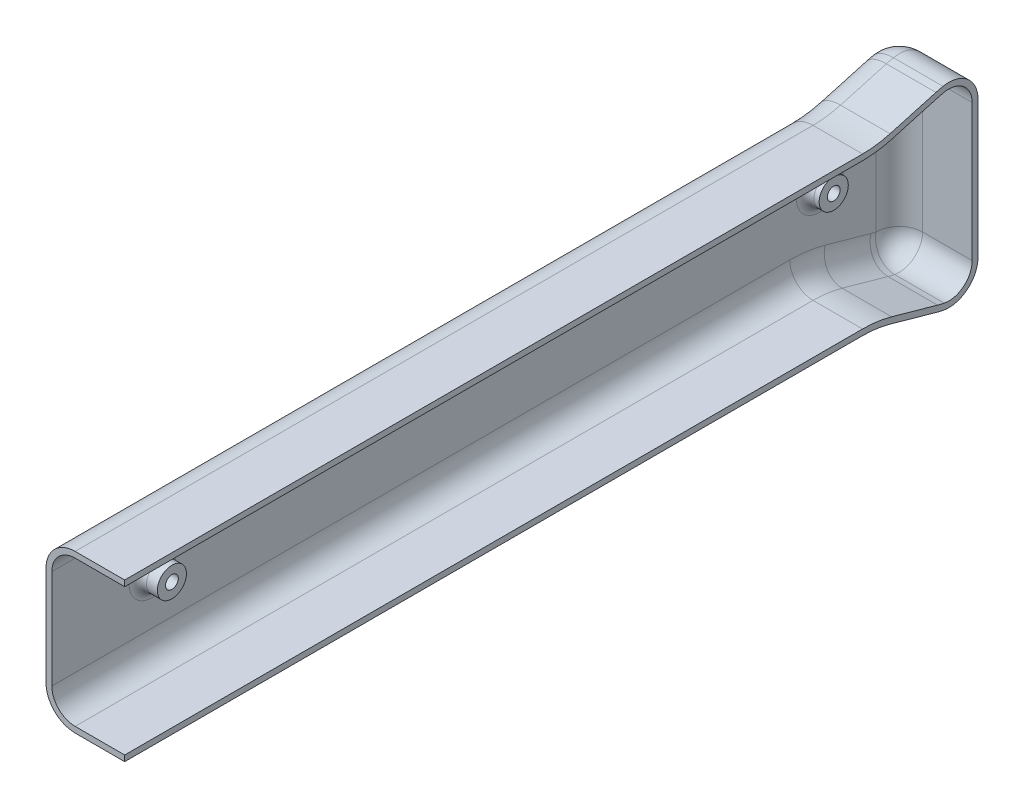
ISO-10303-21;
HEADER;
FILE_DESCRIPTION(('STEP AP214'),'2;1');
FILE_NAME('part.step','',(''),(''),'','','');
FILE_SCHEMA(('AUTOMOTIVE_DESIGN { 1 0 10303 214 1 1 1 1 }'));
ENDSEC;
DATA;
#1=APPLICATION_CONTEXT('core data for automotive mechanical design processes');
#2=APPLICATION_PROTOCOL_DEFINITION('international standard','automotive_design',2000,#1);
#3=PRODUCT_CONTEXT('',#1,'mechanical');
#4=PRODUCT('Part','Part','',(#3));
#5=PRODUCT_RELATED_PRODUCT_CATEGORY('part','',(#4));
#6=PRODUCT_DEFINITION_FORMATION('','',#4);
#7=PRODUCT_DEFINITION_CONTEXT('part definition',#1,'design');
#8=PRODUCT_DEFINITION('design','',#6,#7);
#9=PRODUCT_DEFINITION_SHAPE('','',#8);
#10=(LENGTH_UNIT() NAMED_UNIT(*) SI_UNIT(.MILLI.,.METRE.));
#11=(NAMED_UNIT(*) PLANE_ANGLE_UNIT() SI_UNIT($,.RADIAN.));
#12=(NAMED_UNIT(*) SI_UNIT($,.STERADIAN.) SOLID_ANGLE_UNIT());
#13=UNCERTAINTY_MEASURE_WITH_UNIT(LENGTH_MEASURE(1.E-05),#10,'distance_accuracy_value','');
#14=(GEOMETRIC_REPRESENTATION_CONTEXT(3) GLOBAL_UNCERTAINTY_ASSIGNED_CONTEXT((#13)) GLOBAL_UNIT_ASSIGNED_CONTEXT((#10,
#11,#12)) REPRESENTATION_CONTEXT('',''));
#15=CARTESIAN_POINT('',(0.,0.,0.));
#16=DIRECTION('',(0.,0.,1.));
#17=DIRECTION('',(1.,0.,0.));
#18=AXIS2_PLACEMENT_3D('',#15,#16,#17);
#19=CARTESIAN_POINT('',(13.5,-27.,283.));
#20=DIRECTION('',(-1.,0.,0.));
#21=DIRECTION('',(0.,0.,1.));
#22=AXIS2_PLACEMENT_3D('',#19,#20,#21);
#23=PLANE('',#22);
#24=DIRECTION('',(0.,1.,0.));
#25=VECTOR('',#24,1.);
#26=CARTESIAN_POINT('',(13.5,-27.,283.));
#27=LINE('',#26,#25);
#28=CARTESIAN_POINT('',(13.5,25.,283.));
#29=VERTEX_POINT('',#28);
#30=CARTESIAN_POINT('',(13.5,27.,283.));
#31=VERTEX_POINT('',#30);
#32=EDGE_CURVE('E505',#29,#31,#27,.T.);
#33=ORIENTED_EDGE('',*,*,#32,.F.);
#34=DIRECTION('',(0.,0.,-1.));
#35=VECTOR('',#34,1.);
#36=CARTESIAN_POINT('',(13.5,25.,283.));
#37=LINE('',#36,#35);
#38=CARTESIAN_POINT('',(13.5,25.,29.8075498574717));
#39=VERTEX_POINT('',#38);
#40=EDGE_CURVE('E453',#29,#39,#37,.T.);
#41=ORIENTED_EDGE('',*,*,#40,.T.);
#42=CARTESIAN_POINT('',(13.5,62.,29.8075498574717));
#43=DIRECTION('',(-1.,0.,0.));
#44=DIRECTION('',(0.,0.,1.));
#45=AXIS2_PLACEMENT_3D('',#42,#43,#44);
#46=CIRCLE('',#45,37.);
#47=CARTESIAN_POINT('',(13.5,26.3703312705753,19.8312426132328));
#48=VERTEX_POINT('',#47);
#49=EDGE_CURVE('E373',#48,#39,#46,.T.);
#50=ORIENTED_EDGE('',*,*,#49,.F.);
#51=DIRECTION('',(0.,-0.269629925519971,0.962964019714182));
#52=VECTOR('',#51,1.);
#53=CARTESIAN_POINT('',(13.5,32.0740719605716,-0.539259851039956));
#54=LINE('',#53,#52);
#55=CARTESIAN_POINT('',(13.5,30.777812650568,4.09023768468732));
#56=VERTEX_POINT('',#55);
#57=EDGE_CURVE('E459',#56,#48,#54,.T.);
#58=ORIENTED_EDGE('',*,*,#57,.F.);
#59=CARTESIAN_POINT('',(13.5,-1.,-4.80754985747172));
#60=DIRECTION('',(-1.,0.,0.));
#61=DIRECTION('',(0.,0.,1.));
#62=AXIS2_PLACEMENT_3D('',#59,#60,#61);
#63=CIRCLE('',#62,33.);
#64=CARTESIAN_POINT('',(13.5,31.333264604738,1.79245014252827));
#65=VERTEX_POINT('',#64);
#66=EDGE_CURVE('E392',#65,#56,#63,.F.);
#67=ORIENTED_EDGE('',*,*,#66,.F.);
#68=CARTESIAN_POINT('',(13.5,23.4948974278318,0.192450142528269));
#69=DIRECTION('',(-1.,0.,0.));
#70=DIRECTION('',(0.,0.,1.));
#71=AXIS2_PLACEMENT_3D('',#68,#69,#70);
#72=CIRCLE('',#71,8.);
#73=CARTESIAN_POINT('',(13.5,23.4948974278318,-7.80754985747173));
#74=VERTEX_POINT('',#73);
#75=EDGE_CURVE('E388',#74,#65,#72,.F.);
#76=ORIENTED_EDGE('',*,*,#75,.F.);
#77=DIRECTION('',(0.,1.,0.));
#78=VECTOR('',#77,1.);
#79=CARTESIAN_POINT('',(13.5,-27.,-7.80754985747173));
#80=LINE('',#79,#78);
#81=CARTESIAN_POINT('',(13.5,-23.4948974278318,-7.80754985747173));
#82=VERTEX_POINT('',#81);
#83=EDGE_CURVE('E450',#82,#74,#80,.T.);
#84=ORIENTED_EDGE('',*,*,#83,.F.);
#85=CARTESIAN_POINT('',(13.5,-23.4948974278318,0.192450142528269));
#86=DIRECTION('',(-1.,0.,0.));
#87=DIRECTION('',(0.,0.,1.));
#88=AXIS2_PLACEMENT_3D('',#85,#86,#87);
#89=CIRCLE('',#88,8.);
#90=CARTESIAN_POINT('',(13.5,-31.333264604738,1.79245014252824));
#91=VERTEX_POINT('',#90);
#92=EDGE_CURVE('E362',#91,#82,#89,.F.);
#93=ORIENTED_EDGE('',*,*,#92,.F.);
#94=CARTESIAN_POINT('',(13.5,1.,-4.8075498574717));
#95=DIRECTION('',(-1.,0.,0.));
#96=DIRECTION('',(0.,0.,1.));
#97=AXIS2_PLACEMENT_3D('',#94,#95,#96);
#98=CIRCLE('',#97,33.);
#99=CARTESIAN_POINT('',(13.5,-30.777812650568,4.09023768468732));
#100=VERTEX_POINT('',#99);
#101=EDGE_CURVE('E404',#100,#91,#98,.F.);
#102=ORIENTED_EDGE('',*,*,#101,.F.);
#103=DIRECTION('',(0.,-0.269629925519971,-0.962964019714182));
#104=VECTOR('',#103,1.);
#105=CARTESIAN_POINT('',(13.5,-25.0740719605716,24.4607401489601));
#106=LINE('',#105,#104);
#107=CARTESIAN_POINT('',(13.5,-26.3703312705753,19.8312426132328));
#108=VERTEX_POINT('',#107);
#109=EDGE_CURVE('E455',#108,#100,#106,.T.);
#110=ORIENTED_EDGE('',*,*,#109,.F.);
#111=CARTESIAN_POINT('',(13.5,-62.,29.8075498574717));
#112=DIRECTION('',(-1.,0.,0.));
#113=DIRECTION('',(0.,0.,1.));
#114=AXIS2_PLACEMENT_3D('',#111,#112,#113);
#115=CIRCLE('',#114,37.);
#116=CARTESIAN_POINT('',(13.5,-25.,29.8075498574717));
#117=VERTEX_POINT('',#116);
#118=EDGE_CURVE('E343',#117,#108,#115,.T.);
#119=ORIENTED_EDGE('',*,*,#118,.F.);
#120=DIRECTION('',(0.,0.,-1.));
#121=VECTOR('',#120,1.);
#122=CARTESIAN_POINT('',(13.5,-25.,283.));
#123=LINE('',#122,#121);
#124=CARTESIAN_POINT('',(13.5,-25.,283.));
#125=VERTEX_POINT('',#124);
#126=EDGE_CURVE('E398',#125,#117,#123,.T.);
#127=ORIENTED_EDGE('',*,*,#126,.F.);
#128=CARTESIAN_POINT('',(13.5,-27.,283.));
#129=VERTEX_POINT('',#128);
#130=EDGE_CURVE('E503',#129,#125,#27,.T.);
#131=ORIENTED_EDGE('',*,*,#130,.F.);
#132=DIRECTION('',(0.,0.,-1.));
#133=VECTOR('',#132,1.);
#134=CARTESIAN_POINT('',(13.5,-27.,283.));
#135=LINE('',#134,#133);
#136=CARTESIAN_POINT('',(13.5,-27.,29.8075498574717));
#137=VERTEX_POINT('',#136);
#138=EDGE_CURVE('E509',#129,#137,#135,.T.);
#139=ORIENTED_EDGE('',*,*,#138,.T.);
#140=CARTESIAN_POINT('',(13.5,-62.,29.8075498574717));
#141=DIRECTION('',(-1.,0.,0.));
#142=DIRECTION('',(0.,0.,1.));
#143=AXIS2_PLACEMENT_3D('',#140,#141,#142);
#144=CIRCLE('',#143,35.);
#145=CARTESIAN_POINT('',(13.5,-28.2962593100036,20.3705024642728));
#146=VERTEX_POINT('',#145);
#147=EDGE_CURVE('E544',#137,#146,#144,.T.);
#148=ORIENTED_EDGE('',*,*,#147,.T.);
#149=DIRECTION('',(0.,-0.269629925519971,-0.962964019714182));
#150=VECTOR('',#149,1.);
#151=CARTESIAN_POINT('',(13.5,-27.,25.));
#152=LINE('',#151,#150);
#153=CARTESIAN_POINT('',(13.5,-32.7037406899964,4.62949753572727));
#154=VERTEX_POINT('',#153);
#155=EDGE_CURVE('E485',#146,#154,#152,.T.);
#156=ORIENTED_EDGE('',*,*,#155,.T.);
#157=CARTESIAN_POINT('',(13.5,1.,-4.8075498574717));
#158=DIRECTION('',(-1.,0.,0.));
#159=DIRECTION('',(0.,0.,1.));
#160=AXIS2_PLACEMENT_3D('',#157,#158,#159);
#161=CIRCLE('',#160,35.);
#162=CARTESIAN_POINT('',(13.5,-33.2928563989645,2.19245014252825));
#163=VERTEX_POINT('',#162);
#164=EDGE_CURVE('E525',#154,#163,#161,.F.);
#165=ORIENTED_EDGE('',*,*,#164,.T.);
#166=CARTESIAN_POINT('',(13.5,-23.4948974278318,0.192450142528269));
#167=DIRECTION('',(-1.,0.,0.));
#168=DIRECTION('',(0.,0.,1.));
#169=AXIS2_PLACEMENT_3D('',#166,#167,#168);
#170=CIRCLE('',#169,10.);
#171=CARTESIAN_POINT('',(13.5,-23.4948974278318,-9.80754985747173));
#172=VERTEX_POINT('',#171);
#173=EDGE_CURVE('E561',#163,#172,#170,.F.);
#174=ORIENTED_EDGE('',*,*,#173,.T.);
#175=DIRECTION('',(0.,1.,0.));
#176=VECTOR('',#175,1.);
#177=CARTESIAN_POINT('',(13.5,34.,-9.80754985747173));
#178=LINE('',#177,#176);
#179=CARTESIAN_POINT('',(13.5,23.4948974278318,-9.80754985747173));
#180=VERTEX_POINT('',#179);
#181=EDGE_CURVE('E477',#172,#180,#178,.T.);
#182=ORIENTED_EDGE('',*,*,#181,.T.);
#183=CARTESIAN_POINT('',(13.5,23.4948974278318,0.192450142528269));
#184=DIRECTION('',(-1.,0.,0.));
#185=DIRECTION('',(0.,0.,1.));
#186=AXIS2_PLACEMENT_3D('',#183,#184,#185);
#187=CIRCLE('',#186,10.);
#188=CARTESIAN_POINT('',(13.5,33.2928563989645,2.19245014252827));
#189=VERTEX_POINT('',#188);
#190=EDGE_CURVE('E556',#180,#189,#187,.F.);
#191=ORIENTED_EDGE('',*,*,#190,.T.);
#192=CARTESIAN_POINT('',(13.5,-1.,-4.80754985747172));
#193=DIRECTION('',(-1.,0.,0.));
#194=DIRECTION('',(0.,0.,1.));
#195=AXIS2_PLACEMENT_3D('',#192,#193,#194);
#196=CIRCLE('',#195,35.);
#197=CARTESIAN_POINT('',(13.5,32.7037406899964,4.62949753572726));
#198=VERTEX_POINT('',#197);
#199=EDGE_CURVE('E523',#189,#198,#196,.F.);
#200=ORIENTED_EDGE('',*,*,#199,.T.);
#201=DIRECTION('',(0.,-0.269629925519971,0.962964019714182));
#202=VECTOR('',#201,1.);
#203=CARTESIAN_POINT('',(13.5,34.,0.));
#204=LINE('',#203,#202);
#205=CARTESIAN_POINT('',(13.5,28.2962593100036,20.3705024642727));
#206=VERTEX_POINT('',#205);
#207=EDGE_CURVE('E487',#198,#206,#204,.T.);
#208=ORIENTED_EDGE('',*,*,#207,.T.);
#209=CARTESIAN_POINT('',(13.5,62.,29.8075498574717));
#210=DIRECTION('',(-1.,0.,0.));
#211=DIRECTION('',(0.,0.,1.));
#212=AXIS2_PLACEMENT_3D('',#209,#210,#211);
#213=CIRCLE('',#212,35.);
#214=CARTESIAN_POINT('',(13.5,27.,29.8075498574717));
#215=VERTEX_POINT('',#214);
#216=EDGE_CURVE('E541',#206,#215,#213,.T.);
#217=ORIENTED_EDGE('',*,*,#216,.T.);
#218=DIRECTION('',(0.,0.,-1.));
#219=VECTOR('',#218,1.);
#220=CARTESIAN_POINT('',(13.5,27.,283.));
#221=LINE('',#220,#219);
#222=EDGE_CURVE('E506',#31,#215,#221,.T.);
#223=ORIENTED_EDGE('',*,*,#222,.F.);
#224=EDGE_LOOP('',(#33,#41,#50,#58,#67,#76,#84,#93,#102,#110,#119,#127,#131,#139,#148,#156,#165,
#174,#182,#191,#200,#208,#217,#223));
#225=FACE_BOUND('',#224,.T.);
#226=ADVANCED_FACE('F50',(#225),#23,.F.);
#227=CARTESIAN_POINT('',(-13.5,-27.,283.));
#228=DIRECTION('',(1.,0.,0.));
#229=DIRECTION('',(0.,0.,-1.));
#230=AXIS2_PLACEMENT_3D('',#227,#228,#229);
#231=PLANE('',#230);
#232=CARTESIAN_POINT('',(-13.5,0.,19.5024501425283));
#233=DIRECTION('',(1.,0.,0.));
#234=DIRECTION('',(0.,0.,-1.));
#235=AXIS2_PLACEMENT_3D('',#232,#233,#234);
#236=CIRCLE('',#235,2.2);
#237=CARTESIAN_POINT('',(-13.5,0.,17.3024501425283));
#238=VERTEX_POINT('',#237);
#239=EDGE_CURVE('E1401',#238,#238,#236,.T.);
#240=ORIENTED_EDGE('',*,*,#239,.T.);
#241=EDGE_LOOP('',(#240));
#242=FACE_BOUND('',#241,.T.);
#243=CARTESIAN_POINT('',(-13.5,0.,248.5));
#244=DIRECTION('',(1.,0.,0.));
#245=DIRECTION('',(0.,0.,-1.));
#246=AXIS2_PLACEMENT_3D('',#243,#244,#245);
#247=CIRCLE('',#246,2.2);
#248=CARTESIAN_POINT('',(-13.5,0.,246.3));
#249=VERTEX_POINT('',#248);
#250=EDGE_CURVE('E305',#249,#249,#247,.T.);
#251=ORIENTED_EDGE('',*,*,#250,.T.);
#252=EDGE_LOOP('',(#251));
#253=FACE_BOUND('',#252,.T.);
#254=CARTESIAN_POINT('',(-13.5,-62.,29.8075498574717));
#255=DIRECTION('',(1.,0.,0.));
#256=DIRECTION('',(0.,0.,-1.));
#257=AXIS2_PLACEMENT_3D('',#254,#255,#256);
#258=CIRCLE('',#257,45.);
#259=CARTESIAN_POINT('',(-13.5,-18.6666191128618,17.6742032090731));
#260=VERTEX_POINT('',#259);
#261=CARTESIAN_POINT('',(-13.5,-17.,29.8075498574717));
#262=VERTEX_POINT('',#261);
#263=EDGE_CURVE('E592',#260,#262,#258,.T.);
#264=ORIENTED_EDGE('',*,*,#263,.T.);
#265=DIRECTION('',(0.,0.,-1.));
#266=VECTOR('',#265,1.);
#267=CARTESIAN_POINT('',(-13.5,-17.,283.));
#268=LINE('',#267,#266);
#269=CARTESIAN_POINT('',(-13.5,-17.,283.));
#270=VERTEX_POINT('',#269);
#271=EDGE_CURVE('E597',#262,#270,#268,.F.);
#272=ORIENTED_EDGE('',*,*,#271,.T.);
#273=DIRECTION('',(0.,-1.,0.));
#274=VECTOR('',#273,1.);
#275=CARTESIAN_POINT('',(-13.5,-27.,283.));
#276=LINE('',#275,#274);
#277=CARTESIAN_POINT('',(-13.5,17.,283.));
#278=VERTEX_POINT('',#277);
#279=EDGE_CURVE('E492',#278,#270,#276,.T.);
#280=ORIENTED_EDGE('',*,*,#279,.F.);
#281=DIRECTION('',(0.,0.,-1.));
#282=VECTOR('',#281,1.);
#283=CARTESIAN_POINT('',(-13.5,17.,283.));
#284=LINE('',#283,#282);
#285=CARTESIAN_POINT('',(-13.5,17.,29.8075498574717));
#286=VERTEX_POINT('',#285);
#287=EDGE_CURVE('E575',#278,#286,#284,.T.);
#288=ORIENTED_EDGE('',*,*,#287,.T.);
#289=CARTESIAN_POINT('',(-13.5,62.,29.8075498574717));
#290=DIRECTION('',(1.,0.,0.));
#291=DIRECTION('',(0.,0.,-1.));
#292=AXIS2_PLACEMENT_3D('',#289,#290,#291);
#293=CIRCLE('',#292,45.);
#294=CARTESIAN_POINT('',(-13.5,18.6666191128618,17.674203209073));
#295=VERTEX_POINT('',#294);
#296=EDGE_CURVE('E574',#286,#295,#293,.T.);
#297=ORIENTED_EDGE('',*,*,#296,.T.);
#298=DIRECTION('',(0.,0.269629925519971,-0.962964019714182));
#299=VECTOR('',#298,1.);
#300=CARTESIAN_POINT('',(-13.5,23.0741004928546,1.93319828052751));
#301=LINE('',#300,#299);
#302=CARTESIAN_POINT('',(-13.5,23.0741004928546,1.93319828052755));
#303=VERTEX_POINT('',#302);
#304=EDGE_CURVE('E579',#295,#303,#301,.T.);
#305=ORIENTED_EDGE('',*,*,#304,.T.);
#306=CARTESIAN_POINT('',(-13.5,-1.,-4.80754985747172));
#307=DIRECTION('',(1.,0.,0.));
#308=DIRECTION('',(0.,0.,-1.));
#309=AXIS2_PLACEMENT_3D('',#306,#307,#308);
#310=CIRCLE('',#309,25.);
#311=CARTESIAN_POINT('',(-13.5,23.4948974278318,0.192450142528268));
#312=VERTEX_POINT('',#311);
#313=EDGE_CURVE('E583',#303,#312,#310,.F.);
#314=ORIENTED_EDGE('',*,*,#313,.T.);
#315=DIRECTION('',(0.,1.,0.));
#316=VECTOR('',#315,1.);
#317=CARTESIAN_POINT('',(-13.5,-27.,0.192450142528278));
#318=LINE('',#317,#316);
#319=CARTESIAN_POINT('',(-13.5,-23.4948974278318,0.192450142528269));
#320=VERTEX_POINT('',#319);
#321=EDGE_CURVE('E585',#312,#320,#318,.F.);
#322=ORIENTED_EDGE('',*,*,#321,.T.);
#323=CARTESIAN_POINT('',(-13.5,1.,-4.8075498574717));
#324=DIRECTION('',(1.,0.,0.));
#325=DIRECTION('',(0.,0.,-1.));
#326=AXIS2_PLACEMENT_3D('',#323,#324,#325);
#327=CIRCLE('',#326,25.);
#328=CARTESIAN_POINT('',(-13.5,-23.0741004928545,1.93319828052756));
#329=VERTEX_POINT('',#328);
#330=EDGE_CURVE('E589',#320,#329,#327,.F.);
#331=ORIENTED_EDGE('',*,*,#330,.T.);
#332=DIRECTION('',(0.,0.269629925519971,0.962964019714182));
#333=VECTOR('',#332,1.);
#334=CARTESIAN_POINT('',(-13.5,-18.6666191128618,17.674203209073));
#335=LINE('',#334,#333);
#336=EDGE_CURVE('E586',#329,#260,#335,.T.);
#337=ORIENTED_EDGE('',*,*,#336,.T.);
#338=EDGE_LOOP('',(#264,#272,#280,#288,#297,#305,#314,#322,#331,#337));
#339=FACE_BOUND('',#338,.T.);
#340=ADVANCED_FACE('F705',(#242,#253,#339),#231,.F.);
#341=CARTESIAN_POINT('',(13.5,27.,283.));
#342=DIRECTION('',(0.,-1.,0.));
#343=DIRECTION('',(0.,0.,-1.));
#344=AXIS2_PLACEMENT_3D('',#341,#342,#343);
#345=PLANE('',#344);
#346=DIRECTION('',(-1.,0.,0.));
#347=VECTOR('',#346,1.);
#348=CARTESIAN_POINT('',(13.5,27.,29.8075498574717));
#349=LINE('',#348,#347);
#350=CARTESIAN_POINT('',(-3.5,27.,29.8075498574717));
#351=VERTEX_POINT('',#350);
#352=EDGE_CURVE('E537',#215,#351,#349,.T.);
#353=ORIENTED_EDGE('',*,*,#352,.T.);
#354=DIRECTION('',(0.,0.,-1.));
#355=VECTOR('',#354,1.);
#356=CARTESIAN_POINT('',(-3.5,27.,283.));
#357=LINE('',#356,#355);
#358=CARTESIAN_POINT('',(-3.5,27.,283.));
#359=VERTEX_POINT('',#358);
#360=EDGE_CURVE('E635',#351,#359,#357,.F.);
#361=ORIENTED_EDGE('',*,*,#360,.T.);
#362=DIRECTION('',(-1.,0.,0.));
#363=VECTOR('',#362,1.);
#364=CARTESIAN_POINT('',(13.5,27.,283.));
#365=LINE('',#364,#363);
#366=EDGE_CURVE('E493',#31,#359,#365,.T.);
#367=ORIENTED_EDGE('',*,*,#366,.F.);
#368=ORIENTED_EDGE('',*,*,#222,.T.);
#369=EDGE_LOOP('',(#353,#361,#367,#368));
#370=FACE_BOUND('',#369,.T.);
#371=ADVANCED_FACE('F706',(#370),#345,.F.);
#372=CARTESIAN_POINT('',(13.5,-27.,283.));
#373=DIRECTION('',(0.,1.,0.));
#374=DIRECTION('',(0.,0.,1.));
#375=AXIS2_PLACEMENT_3D('',#372,#373,#374);
#376=PLANE('',#375);
#377=DIRECTION('',(1.,0.,0.));
#378=VECTOR('',#377,1.);
#379=CARTESIAN_POINT('',(13.5,-27.,283.));
#380=LINE('',#379,#378);
#381=CARTESIAN_POINT('',(-3.5,-27.,283.));
#382=VERTEX_POINT('',#381);
#383=EDGE_CURVE('E497',#382,#129,#380,.T.);
#384=ORIENTED_EDGE('',*,*,#383,.F.);
#385=DIRECTION('',(0.,0.,-1.));
#386=VECTOR('',#385,1.);
#387=CARTESIAN_POINT('',(-3.5,-27.,283.));
#388=LINE('',#387,#386);
#389=CARTESIAN_POINT('',(-3.5,-27.,29.8075498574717));
#390=VERTEX_POINT('',#389);
#391=EDGE_CURVE('E568',#382,#390,#388,.T.);
#392=ORIENTED_EDGE('',*,*,#391,.T.);
#393=DIRECTION('',(-1.,0.,0.));
#394=VECTOR('',#393,1.);
#395=CARTESIAN_POINT('',(13.5,-27.,29.8075498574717));
#396=LINE('',#395,#394);
#397=EDGE_CURVE('E527',#390,#137,#396,.F.);
#398=ORIENTED_EDGE('',*,*,#397,.T.);
#399=ORIENTED_EDGE('',*,*,#138,.F.);
#400=EDGE_LOOP('',(#384,#392,#398,#399));
#401=FACE_BOUND('',#400,.T.);
#402=ADVANCED_FACE('F718',(#401),#376,.F.);
#403=CARTESIAN_POINT('',(0.,0.,283.));
#404=DIRECTION('',(0.,0.,-1.));
#405=DIRECTION('',(-1.,0.,0.));
#406=AXIS2_PLACEMENT_3D('',#403,#404,#405);
#407=PLANE('',#406);
#408=CARTESIAN_POINT('',(-3.5,17.,283.));
#409=DIRECTION('',(0.,0.,-1.));
#410=DIRECTION('',(-1.,0.,0.));
#411=AXIS2_PLACEMENT_3D('',#408,#409,#410);
#412=CIRCLE('',#411,8.);
#413=CARTESIAN_POINT('',(-11.5,17.,283.));
#414=VERTEX_POINT('',#413);
#415=CARTESIAN_POINT('',(-3.5,25.,283.));
#416=VERTEX_POINT('',#415);
#417=EDGE_CURVE('E293',#414,#416,#412,.T.);
#418=ORIENTED_EDGE('',*,*,#417,.T.);
#419=DIRECTION('',(1.,0.,0.));
#420=VECTOR('',#419,1.);
#421=CARTESIAN_POINT('',(-3.5,25.,283.));
#422=LINE('',#421,#420);
#423=EDGE_CURVE('E308',#416,#29,#422,.T.);
#424=ORIENTED_EDGE('',*,*,#423,.T.);
#425=ORIENTED_EDGE('',*,*,#32,.T.);
#426=ORIENTED_EDGE('',*,*,#366,.T.);
#427=CARTESIAN_POINT('',(-3.5,17.,283.));
#428=DIRECTION('',(0.,0.,-1.));
#429=DIRECTION('',(-1.,0.,0.));
#430=AXIS2_PLACEMENT_3D('',#427,#428,#429);
#431=CIRCLE('',#430,10.);
#432=EDGE_CURVE('E599',#359,#278,#431,.F.);
#433=ORIENTED_EDGE('',*,*,#432,.T.);
#434=ORIENTED_EDGE('',*,*,#279,.T.);
#435=CARTESIAN_POINT('',(-3.5,-17.,283.));
#436=DIRECTION('',(0.,0.,-1.));
#437=DIRECTION('',(-1.,0.,0.));
#438=AXIS2_PLACEMENT_3D('',#435,#436,#437);
#439=CIRCLE('',#438,10.);
#440=EDGE_CURVE('E604',#270,#382,#439,.F.);
#441=ORIENTED_EDGE('',*,*,#440,.T.);
#442=ORIENTED_EDGE('',*,*,#383,.T.);
#443=ORIENTED_EDGE('',*,*,#130,.T.);
#444=DIRECTION('',(-1.,0.,0.));
#445=VECTOR('',#444,1.);
#446=CARTESIAN_POINT('',(13.5,-25.,283.));
#447=LINE('',#446,#445);
#448=CARTESIAN_POINT('',(-3.5,-25.,283.));
#449=VERTEX_POINT('',#448);
#450=EDGE_CURVE('E298',#125,#449,#447,.T.);
#451=ORIENTED_EDGE('',*,*,#450,.T.);
#452=CARTESIAN_POINT('',(-3.5,-17.,283.));
#453=DIRECTION('',(0.,0.,-1.));
#454=DIRECTION('',(-1.,0.,0.));
#455=AXIS2_PLACEMENT_3D('',#452,#453,#454);
#456=CIRCLE('',#455,8.);
#457=CARTESIAN_POINT('',(-11.5,-17.,283.));
#458=VERTEX_POINT('',#457);
#459=EDGE_CURVE('E279',#449,#458,#456,.T.);
#460=ORIENTED_EDGE('',*,*,#459,.T.);
#461=DIRECTION('',(0.,1.,0.));
#462=VECTOR('',#461,1.);
#463=CARTESIAN_POINT('',(-11.5,-17.,283.));
#464=LINE('',#463,#462);
#465=EDGE_CURVE('E286',#458,#414,#464,.T.);
#466=ORIENTED_EDGE('',*,*,#465,.T.);
#467=EDGE_LOOP('',(#418,#424,#425,#426,#433,#434,#441,#442,#443,#451,#460,#466));
#468=FACE_BOUND('',#467,.T.);
#469=ADVANCED_FACE('F291',(#468),#407,.F.);
#470=CARTESIAN_POINT('',(157.559015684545,34.,0.));
#471=DIRECTION('',(0.,0.962964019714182,0.269629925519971));
#472=DIRECTION('',(0.,-0.269629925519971,0.962964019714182));
#473=AXIS2_PLACEMENT_3D('',#470,#471,#472);
#474=PLANE('',#473);
#475=DIRECTION('',(-1.,0.,0.));
#476=VECTOR('',#475,1.);
#477=CARTESIAN_POINT('',(157.559015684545,32.7037406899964,4.62949753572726));
#478=LINE('',#477,#476);
#479=CARTESIAN_POINT('',(-3.5,32.7037406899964,4.62949753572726));
#480=VERTEX_POINT('',#479);
#481=EDGE_CURVE('E534',#198,#480,#478,.T.);
#482=ORIENTED_EDGE('',*,*,#481,.T.);
#483=DIRECTION('',(0.,0.269629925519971,-0.962964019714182));
#484=VECTOR('',#483,1.);
#485=CARTESIAN_POINT('',(-3.5,28.2962593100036,20.3705024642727));
#486=LINE('',#485,#484);
#487=CARTESIAN_POINT('',(-3.5,28.2962593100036,20.3705024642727));
#488=VERTEX_POINT('',#487);
#489=EDGE_CURVE('E626',#480,#488,#486,.F.);
#490=ORIENTED_EDGE('',*,*,#489,.T.);
#491=DIRECTION('',(-1.,0.,0.));
#492=VECTOR('',#491,1.);
#493=CARTESIAN_POINT('',(157.559015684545,28.2962593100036,20.3705024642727));
#494=LINE('',#493,#492);
#495=EDGE_CURVE('E532',#488,#206,#494,.F.);
#496=ORIENTED_EDGE('',*,*,#495,.T.);
#497=ORIENTED_EDGE('',*,*,#207,.F.);
#498=EDGE_LOOP('',(#482,#490,#496,#497));
#499=FACE_BOUND('',#498,.T.);
#500=ADVANCED_FACE('F907',(#499),#474,.T.);
#501=CARTESIAN_POINT('',(157.559015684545,-27.,25.));
#502=DIRECTION('',(0.,-0.962964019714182,0.269629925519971));
#503=DIRECTION('',(0.,-0.269629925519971,-0.962964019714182));
#504=AXIS2_PLACEMENT_3D('',#501,#502,#503);
#505=PLANE('',#504);
#506=DIRECTION('',(-1.,0.,0.));
#507=VECTOR('',#506,1.);
#508=CARTESIAN_POINT('',(157.559015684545,-28.2962593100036,20.3705024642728));
#509=LINE('',#508,#507);
#510=CARTESIAN_POINT('',(-3.5,-28.2962593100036,20.3705024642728));
#511=VERTEX_POINT('',#510);
#512=EDGE_CURVE('E511',#146,#511,#509,.T.);
#513=ORIENTED_EDGE('',*,*,#512,.T.);
#514=DIRECTION('',(0.,0.269629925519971,0.962964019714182));
#515=VECTOR('',#514,1.);
#516=CARTESIAN_POINT('',(-3.5,-32.7037406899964,4.62949753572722));
#517=LINE('',#516,#515);
#518=CARTESIAN_POINT('',(-3.5,-32.7037406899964,4.62949753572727));
#519=VERTEX_POINT('',#518);
#520=EDGE_CURVE('E607',#511,#519,#517,.F.);
#521=ORIENTED_EDGE('',*,*,#520,.T.);
#522=DIRECTION('',(-1.,0.,0.));
#523=VECTOR('',#522,1.);
#524=CARTESIAN_POINT('',(157.559015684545,-32.7037406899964,4.62949753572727));
#525=LINE('',#524,#523);
#526=EDGE_CURVE('E517',#519,#154,#525,.F.);
#527=ORIENTED_EDGE('',*,*,#526,.T.);
#528=ORIENTED_EDGE('',*,*,#155,.F.);
#529=EDGE_LOOP('',(#513,#521,#527,#528));
#530=FACE_BOUND('',#529,.T.);
#531=ADVANCED_FACE('F730',(#530),#505,.T.);
#532=CARTESIAN_POINT('',(157.559015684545,1.,-4.8075498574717));
#533=DIRECTION('',(-1.,0.,0.));
#534=DIRECTION('',(0.,0.,1.));
#535=AXIS2_PLACEMENT_3D('',#532,#533,#534);
#536=CYLINDRICAL_SURFACE('',#535,35.);
#537=ORIENTED_EDGE('',*,*,#526,.F.);
#538=CARTESIAN_POINT('',(-3.5,1.,-4.8075498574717));
#539=DIRECTION('',(1.,0.,0.));
#540=DIRECTION('',(0.,0.,-1.));
#541=AXIS2_PLACEMENT_3D('',#538,#539,#540);
#542=CIRCLE('',#541,35.);
#543=CARTESIAN_POINT('',(-3.5,-33.2928563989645,2.19245014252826));
#544=VERTEX_POINT('',#543);
#545=EDGE_CURVE('E611',#519,#544,#542,.T.);
#546=ORIENTED_EDGE('',*,*,#545,.T.);
#547=DIRECTION('',(-1.,0.,0.));
#548=VECTOR('',#547,1.);
#549=CARTESIAN_POINT('',(157.559015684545,-33.2928563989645,2.19245014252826));
#550=LINE('',#549,#548);
#551=EDGE_CURVE('E554',#544,#163,#550,.F.);
#552=ORIENTED_EDGE('',*,*,#551,.T.);
#553=ORIENTED_EDGE('',*,*,#164,.F.);
#554=EDGE_LOOP('',(#537,#546,#552,#553));
#555=FACE_BOUND('',#554,.T.);
#556=ADVANCED_FACE('F722',(#555),#536,.T.);
#557=CARTESIAN_POINT('',(157.559015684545,-62.,29.8075498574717));
#558=DIRECTION('',(-1.,0.,0.));
#559=DIRECTION('',(0.,0.,1.));
#560=AXIS2_PLACEMENT_3D('',#557,#558,#559);
#561=CYLINDRICAL_SURFACE('',#560,35.);
#562=ORIENTED_EDGE('',*,*,#397,.F.);
#563=CARTESIAN_POINT('',(-3.5,-62.,29.8075498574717));
#564=DIRECTION('',(1.,0.,0.));
#565=DIRECTION('',(0.,0.,-1.));
#566=AXIS2_PLACEMENT_3D('',#563,#564,#565);
#567=CIRCLE('',#566,35.);
#568=EDGE_CURVE('E601',#390,#511,#567,.F.);
#569=ORIENTED_EDGE('',*,*,#568,.T.);
#570=ORIENTED_EDGE('',*,*,#512,.F.);
#571=ORIENTED_EDGE('',*,*,#147,.F.);
#572=EDGE_LOOP('',(#562,#569,#570,#571));
#573=FACE_BOUND('',#572,.T.);
#574=ADVANCED_FACE('F727',(#573),#561,.F.);
#575=CARTESIAN_POINT('',(157.559015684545,-1.,-4.80754985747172));
#576=DIRECTION('',(-1.,0.,0.));
#577=DIRECTION('',(0.,0.,1.));
#578=AXIS2_PLACEMENT_3D('',#575,#576,#577);
#579=CYLINDRICAL_SURFACE('',#578,35.);
#580=DIRECTION('',(-1.,0.,0.));
#581=VECTOR('',#580,1.);
#582=CARTESIAN_POINT('',(157.559015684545,33.2928563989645,2.19245014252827));
#583=LINE('',#582,#581);
#584=CARTESIAN_POINT('',(-3.5,33.2928563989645,2.19245014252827));
#585=VERTEX_POINT('',#584);
#586=EDGE_CURVE('E562',#189,#585,#583,.T.);
#587=ORIENTED_EDGE('',*,*,#586,.T.);
#588=CARTESIAN_POINT('',(-3.5,-1.,-4.80754985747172));
#589=DIRECTION('',(1.,0.,0.));
#590=DIRECTION('',(0.,0.,-1.));
#591=AXIS2_PLACEMENT_3D('',#588,#589,#590);
#592=CIRCLE('',#591,35.);
#593=EDGE_CURVE('E621',#585,#480,#592,.T.);
#594=ORIENTED_EDGE('',*,*,#593,.T.);
#595=ORIENTED_EDGE('',*,*,#481,.F.);
#596=ORIENTED_EDGE('',*,*,#199,.F.);
#597=EDGE_LOOP('',(#587,#594,#595,#596));
#598=FACE_BOUND('',#597,.T.);
#599=ADVANCED_FACE('F733',(#598),#579,.T.);
#600=CARTESIAN_POINT('',(13.5,62.,29.8075498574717));
#601=DIRECTION('',(-1.,0.,0.));
#602=DIRECTION('',(0.,0.,1.));
#603=AXIS2_PLACEMENT_3D('',#600,#601,#602);
#604=CYLINDRICAL_SURFACE('',#603,35.);
#605=ORIENTED_EDGE('',*,*,#495,.F.);
#606=CARTESIAN_POINT('',(-3.5,62.,29.8075498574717));
#607=DIRECTION('',(1.,0.,0.));
#608=DIRECTION('',(0.,0.,-1.));
#609=AXIS2_PLACEMENT_3D('',#606,#607,#608);
#610=CIRCLE('',#609,35.);
#611=EDGE_CURVE('E627',#488,#351,#610,.F.);
#612=ORIENTED_EDGE('',*,*,#611,.T.);
#613=ORIENTED_EDGE('',*,*,#352,.F.);
#614=ORIENTED_EDGE('',*,*,#216,.F.);
#615=EDGE_LOOP('',(#605,#612,#613,#614));
#616=FACE_BOUND('',#615,.T.);
#617=ADVANCED_FACE('F731',(#616),#604,.F.);
#618=CARTESIAN_POINT('',(13.5,34.,-9.80754985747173));
#619=DIRECTION('',(0.,0.,1.));
#620=DIRECTION('',(1.,0.,0.));
#621=AXIS2_PLACEMENT_3D('',#618,#619,#620);
#622=PLANE('',#621);
#623=DIRECTION('',(1.,0.,0.));
#624=VECTOR('',#623,1.);
#625=CARTESIAN_POINT('',(-13.5,-23.4948974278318,-9.80754985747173));
#626=LINE('',#625,#624);
#627=CARTESIAN_POINT('',(-3.5,-23.4948974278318,-9.80754985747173));
#628=VERTEX_POINT('',#627);
#629=EDGE_CURVE('E553',#172,#628,#626,.F.);
#630=ORIENTED_EDGE('',*,*,#629,.T.);
#631=DIRECTION('',(0.,1.,0.));
#632=VECTOR('',#631,1.);
#633=CARTESIAN_POINT('',(-3.5,34.,-9.80754985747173));
#634=LINE('',#633,#632);
#635=CARTESIAN_POINT('',(-3.5,23.4948974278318,-9.80754985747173));
#636=VERTEX_POINT('',#635);
#637=EDGE_CURVE('E617',#628,#636,#634,.T.);
#638=ORIENTED_EDGE('',*,*,#637,.T.);
#639=DIRECTION('',(1.,0.,0.));
#640=VECTOR('',#639,1.);
#641=CARTESIAN_POINT('',(13.5,23.4948974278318,-9.80754985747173));
#642=LINE('',#641,#640);
#643=EDGE_CURVE('E547',#636,#180,#642,.T.);
#644=ORIENTED_EDGE('',*,*,#643,.T.);
#645=ORIENTED_EDGE('',*,*,#181,.F.);
#646=EDGE_LOOP('',(#630,#638,#644,#645));
#647=FACE_BOUND('',#646,.T.);
#648=ADVANCED_FACE('F740',(#647),#622,.F.);
#649=CARTESIAN_POINT('',(157.559015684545,-23.4948974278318,0.192450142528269));
#650=DIRECTION('',(-1.,0.,0.));
#651=DIRECTION('',(0.,0.,1.));
#652=AXIS2_PLACEMENT_3D('',#649,#650,#651);
#653=CYLINDRICAL_SURFACE('',#652,10.);
#654=ORIENTED_EDGE('',*,*,#551,.F.);
#655=CARTESIAN_POINT('',(-3.5,-23.4948974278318,0.192450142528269));
#656=DIRECTION('',(-1.,0.,0.));
#657=DIRECTION('',(0.,0.,1.));
#658=AXIS2_PLACEMENT_3D('',#655,#656,#657);
#659=CIRCLE('',#658,10.);
#660=EDGE_CURVE('E613',#544,#628,#659,.F.);
#661=ORIENTED_EDGE('',*,*,#660,.T.);
#662=ORIENTED_EDGE('',*,*,#629,.F.);
#663=ORIENTED_EDGE('',*,*,#173,.F.);
#664=EDGE_LOOP('',(#654,#661,#662,#663));
#665=FACE_BOUND('',#664,.T.);
#666=ADVANCED_FACE('F741',(#665),#653,.T.);
#667=CARTESIAN_POINT('',(157.559015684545,23.4948974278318,0.192450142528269));
#668=DIRECTION('',(-1.,0.,0.));
#669=DIRECTION('',(0.,0.,1.));
#670=AXIS2_PLACEMENT_3D('',#667,#668,#669);
#671=CYLINDRICAL_SURFACE('',#670,10.);
#672=ORIENTED_EDGE('',*,*,#643,.F.);
#673=CARTESIAN_POINT('',(-3.5,23.4948974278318,0.192450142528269));
#674=DIRECTION('',(-1.,0.,0.));
#675=DIRECTION('',(0.,0.,1.));
#676=AXIS2_PLACEMENT_3D('',#673,#674,#675);
#677=CIRCLE('',#676,10.);
#678=EDGE_CURVE('E619',#636,#585,#677,.F.);
#679=ORIENTED_EDGE('',*,*,#678,.T.);
#680=ORIENTED_EDGE('',*,*,#586,.F.);
#681=ORIENTED_EDGE('',*,*,#190,.F.);
#682=EDGE_LOOP('',(#672,#679,#680,#681));
#683=FACE_BOUND('',#682,.T.);
#684=ADVANCED_FACE('F743',(#683),#671,.T.);
#685=CARTESIAN_POINT('',(-3.5,17.,283.));
#686=DIRECTION('',(0.,0.,-1.));
#687=DIRECTION('',(-1.,0.,0.));
#688=AXIS2_PLACEMENT_3D('',#685,#686,#687);
#689=CYLINDRICAL_SURFACE('',#688,10.);
#690=ORIENTED_EDGE('',*,*,#432,.F.);
#691=ORIENTED_EDGE('',*,*,#360,.F.);
#692=CARTESIAN_POINT('',(-3.5,17.,29.8075498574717));
#693=DIRECTION('',(0.,0.,-1.));
#694=DIRECTION('',(-1.,0.,0.));
#695=AXIS2_PLACEMENT_3D('',#692,#693,#694);
#696=CIRCLE('',#695,10.);
#697=EDGE_CURVE('E482',#286,#351,#696,.T.);
#698=ORIENTED_EDGE('',*,*,#697,.F.);
#699=ORIENTED_EDGE('',*,*,#287,.F.);
#700=EDGE_LOOP('',(#690,#691,#698,#699));
#701=FACE_BOUND('',#700,.T.);
#702=ADVANCED_FACE('F746',(#701),#689,.T.);
#703=CARTESIAN_POINT('',(-3.5,62.,29.8075498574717));
#704=DIRECTION('',(1.,0.,0.));
#705=DIRECTION('',(0.,0.,-1.));
#706=AXIS2_PLACEMENT_3D('',#703,#704,#705);
#707=TOROIDAL_SURFACE('',#706,45.,10.);
#708=ORIENTED_EDGE('',*,*,#697,.T.);
#709=ORIENTED_EDGE('',*,*,#611,.F.);
#710=CARTESIAN_POINT('',(-3.5,18.6666191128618,17.674203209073));
#711=DIRECTION('',(0.,0.269629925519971,-0.962964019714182));
#712=DIRECTION('',(0.,0.962964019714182,0.269629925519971));
#713=AXIS2_PLACEMENT_3D('',#710,#711,#712);
#714=CIRCLE('',#713,10.);
#715=EDGE_CURVE('E668',#295,#488,#714,.T.);
#716=ORIENTED_EDGE('',*,*,#715,.F.);
#717=ORIENTED_EDGE('',*,*,#296,.F.);
#718=EDGE_LOOP('',(#708,#709,#716,#717));
#719=FACE_BOUND('',#718,.T.);
#720=ADVANCED_FACE('F781',(#719),#707,.T.);
#721=CARTESIAN_POINT('',(-3.5,-53.5435867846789,275.56779570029));
#722=DIRECTION('',(0.,-0.269629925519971,0.962964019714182));
#723=DIRECTION('',(0.,-0.962964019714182,-0.269629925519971));
#724=AXIS2_PLACEMENT_3D('',#721,#722,#723);
#725=CYLINDRICAL_SURFACE('',#724,10.);
#726=ORIENTED_EDGE('',*,*,#715,.T.);
#727=ORIENTED_EDGE('',*,*,#489,.F.);
#728=CARTESIAN_POINT('',(-3.5,23.0741004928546,1.93319828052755));
#729=DIRECTION('',(0.,0.269629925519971,-0.962964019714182));
#730=DIRECTION('',(0.,0.962964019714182,0.269629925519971));
#731=AXIS2_PLACEMENT_3D('',#728,#729,#730);
#732=CIRCLE('',#731,10.);
#733=EDGE_CURVE('E665',#303,#480,#732,.T.);
#734=ORIENTED_EDGE('',*,*,#733,.F.);
#735=ORIENTED_EDGE('',*,*,#304,.F.);
#736=EDGE_LOOP('',(#726,#727,#734,#735));
#737=FACE_BOUND('',#736,.T.);
#738=ADVANCED_FACE('F783',(#737),#725,.T.);
#739=CARTESIAN_POINT('',(-3.5,-1.,-4.80754985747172));
#740=DIRECTION('',(1.,0.,0.));
#741=DIRECTION('',(0.,0.,-1.));
#742=AXIS2_PLACEMENT_3D('',#739,#740,#741);
#743=TOROIDAL_SURFACE('',#742,25.,10.);
#744=ORIENTED_EDGE('',*,*,#733,.T.);
#745=ORIENTED_EDGE('',*,*,#593,.F.);
#746=CARTESIAN_POINT('',(-3.5,23.4948974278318,0.192450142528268));
#747=DIRECTION('',(0.,0.2,-0.979795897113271));
#748=DIRECTION('',(0.,0.979795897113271,0.2));
#749=AXIS2_PLACEMENT_3D('',#746,#747,#748);
#750=CIRCLE('',#749,10.);
#751=EDGE_CURVE('E657',#312,#585,#750,.T.);
#752=ORIENTED_EDGE('',*,*,#751,.F.);
#753=ORIENTED_EDGE('',*,*,#313,.F.);
#754=EDGE_LOOP('',(#744,#745,#752,#753));
#755=FACE_BOUND('',#754,.T.);
#756=ADVANCED_FACE('F779',(#755),#743,.T.);
#757=CARTESIAN_POINT('',(-3.5,23.4948974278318,0.192450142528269));
#758=DIRECTION('',(1.,0.,0.));
#759=DIRECTION('',(0.,0.,-1.));
#760=AXIS2_PLACEMENT_3D('',#757,#758,#759);
#761=SPHERICAL_SURFACE('',#760,10.);
#762=ORIENTED_EDGE('',*,*,#751,.T.);
#763=ORIENTED_EDGE('',*,*,#678,.F.);
#764=CARTESIAN_POINT('',(-3.5,23.4948974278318,0.192450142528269));
#765=DIRECTION('',(0.,-1.,0.));
#766=DIRECTION('',(0.,0.,-1.));
#767=AXIS2_PLACEMENT_3D('',#764,#765,#766);
#768=CIRCLE('',#767,10.);
#769=EDGE_CURVE('E655',#312,#636,#768,.T.);
#770=ORIENTED_EDGE('',*,*,#769,.F.);
#771=EDGE_LOOP('',(#762,#763,#770));
#772=FACE_BOUND('',#771,.T.);
#773=ADVANCED_FACE('F774',(#772),#761,.T.);
#774=CARTESIAN_POINT('',(-3.5,34.,0.192450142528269));
#775=DIRECTION('',(0.,1.,0.));
#776=DIRECTION('',(0.,0.,1.));
#777=AXIS2_PLACEMENT_3D('',#774,#775,#776);
#778=CYLINDRICAL_SURFACE('',#777,10.);
#779=ORIENTED_EDGE('',*,*,#769,.T.);
#780=ORIENTED_EDGE('',*,*,#637,.F.);
#781=CARTESIAN_POINT('',(-3.5,-23.4948974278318,0.192450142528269));
#782=DIRECTION('',(0.,-1.,0.));
#783=DIRECTION('',(0.,0.,-1.));
#784=AXIS2_PLACEMENT_3D('',#781,#782,#783);
#785=CIRCLE('',#784,10.);
#786=EDGE_CURVE('E646',#320,#628,#785,.T.);
#787=ORIENTED_EDGE('',*,*,#786,.F.);
#788=ORIENTED_EDGE('',*,*,#321,.F.);
#789=EDGE_LOOP('',(#779,#780,#787,#788));
#790=FACE_BOUND('',#789,.T.);
#791=ADVANCED_FACE('F768',(#790),#778,.T.);
#792=CARTESIAN_POINT('',(-3.5,-23.4948974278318,0.192450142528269));
#793=DIRECTION('',(1.,0.,0.));
#794=DIRECTION('',(0.,0.,-1.));
#795=AXIS2_PLACEMENT_3D('',#792,#793,#794);
#796=SPHERICAL_SURFACE('',#795,10.);
#797=ORIENTED_EDGE('',*,*,#786,.T.);
#798=ORIENTED_EDGE('',*,*,#660,.F.);
#799=CARTESIAN_POINT('',(-3.5,-23.4948974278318,0.192450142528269));
#800=DIRECTION('',(0.,0.199999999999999,0.979795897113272));
#801=DIRECTION('',(0.,-0.979795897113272,0.199999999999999));
#802=AXIS2_PLACEMENT_3D('',#799,#800,#801);
#803=CIRCLE('',#802,10.);
#804=EDGE_CURVE('E648',#320,#544,#803,.T.);
#805=ORIENTED_EDGE('',*,*,#804,.F.);
#806=EDGE_LOOP('',(#797,#798,#805));
#807=FACE_BOUND('',#806,.T.);
#808=ADVANCED_FACE('F764',(#807),#796,.T.);
#809=CARTESIAN_POINT('',(-3.5,1.,-4.8075498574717));
#810=DIRECTION('',(1.,0.,0.));
#811=DIRECTION('',(0.,0.,-1.));
#812=AXIS2_PLACEMENT_3D('',#809,#810,#811);
#813=TOROIDAL_SURFACE('',#812,25.,10.);
#814=ORIENTED_EDGE('',*,*,#804,.T.);
#815=ORIENTED_EDGE('',*,*,#545,.F.);
#816=CARTESIAN_POINT('',(-3.5,-23.0741004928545,1.93319828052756));
#817=DIRECTION('',(0.,0.269629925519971,0.962964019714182));
#818=DIRECTION('',(0.,-0.962964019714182,0.269629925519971));
#819=AXIS2_PLACEMENT_3D('',#816,#817,#818);
#820=CIRCLE('',#819,10.);
#821=EDGE_CURVE('E645',#329,#519,#820,.T.);
#822=ORIENTED_EDGE('',*,*,#821,.F.);
#823=ORIENTED_EDGE('',*,*,#330,.F.);
#824=EDGE_LOOP('',(#814,#815,#822,#823));
#825=FACE_BOUND('',#824,.T.);
#826=ADVANCED_FACE('F761',(#825),#813,.T.);
#827=CARTESIAN_POINT('',(-3.5,49.61777076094,261.547024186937));
#828=DIRECTION('',(0.,-0.269629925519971,-0.962964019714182));
#829=DIRECTION('',(0.,0.962964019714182,-0.269629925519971));
#830=AXIS2_PLACEMENT_3D('',#827,#828,#829);
#831=CYLINDRICAL_SURFACE('',#830,10.);
#832=ORIENTED_EDGE('',*,*,#821,.T.);
#833=ORIENTED_EDGE('',*,*,#520,.F.);
#834=CARTESIAN_POINT('',(-3.5,-18.6666191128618,17.6742032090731));
#835=DIRECTION('',(0.,0.269629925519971,0.962964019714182));
#836=DIRECTION('',(0.,-0.962964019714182,0.269629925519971));
#837=AXIS2_PLACEMENT_3D('',#834,#835,#836);
#838=CIRCLE('',#837,10.);
#839=EDGE_CURVE('E637',#260,#511,#838,.T.);
#840=ORIENTED_EDGE('',*,*,#839,.F.);
#841=ORIENTED_EDGE('',*,*,#336,.F.);
#842=EDGE_LOOP('',(#832,#833,#840,#841));
#843=FACE_BOUND('',#842,.T.);
#844=ADVANCED_FACE('F760',(#843),#831,.T.);
#845=CARTESIAN_POINT('',(-3.5,-62.,29.8075498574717));
#846=DIRECTION('',(1.,0.,0.));
#847=DIRECTION('',(0.,0.,-1.));
#848=AXIS2_PLACEMENT_3D('',#845,#846,#847);
#849=TOROIDAL_SURFACE('',#848,45.,10.);
#850=ORIENTED_EDGE('',*,*,#839,.T.);
#851=ORIENTED_EDGE('',*,*,#568,.F.);
#852=CARTESIAN_POINT('',(-3.5,-17.,29.8075498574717));
#853=DIRECTION('',(0.,0.,1.));
#854=DIRECTION('',(1.,0.,0.));
#855=AXIS2_PLACEMENT_3D('',#852,#853,#854);
#856=CIRCLE('',#855,10.);
#857=EDGE_CURVE('E348',#262,#390,#856,.T.);
#858=ORIENTED_EDGE('',*,*,#857,.F.);
#859=ORIENTED_EDGE('',*,*,#263,.F.);
#860=EDGE_LOOP('',(#850,#851,#858,#859));
#861=FACE_BOUND('',#860,.T.);
#862=ADVANCED_FACE('F751',(#861),#849,.T.);
#863=CARTESIAN_POINT('',(-3.5,-17.,283.));
#864=DIRECTION('',(0.,0.,-1.));
#865=DIRECTION('',(-1.,0.,0.));
#866=AXIS2_PLACEMENT_3D('',#863,#864,#865);
#867=CYLINDRICAL_SURFACE('',#866,10.);
#868=ORIENTED_EDGE('',*,*,#440,.F.);
#869=ORIENTED_EDGE('',*,*,#271,.F.);
#870=ORIENTED_EDGE('',*,*,#857,.T.);
#871=ORIENTED_EDGE('',*,*,#391,.F.);
#872=EDGE_LOOP('',(#868,#869,#870,#871));
#873=FACE_BOUND('',#872,.T.);
#874=ADVANCED_FACE('F749',(#873),#867,.T.);
#875=CARTESIAN_POINT('',(-11.5,-27.,283.));
#876=DIRECTION('',(1.,0.,0.));
#877=DIRECTION('',(0.,0.,-1.));
#878=AXIS2_PLACEMENT_3D('',#875,#876,#877);
#879=PLANE('',#878);
#880=CARTESIAN_POINT('',(-11.5,0.,19.5024501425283));
#881=DIRECTION('',(1.,0.,0.));
#882=DIRECTION('',(0.,0.,-1.));
#883=AXIS2_PLACEMENT_3D('',#880,#881,#882);
#884=CIRCLE('',#883,8.);
#885=CARTESIAN_POINT('',(-11.5,0.,11.5024501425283));
#886=VERTEX_POINT('',#885);
#887=EDGE_CURVE('E11',#886,#886,#884,.F.);
#888=ORIENTED_EDGE('',*,*,#887,.T.);
#889=EDGE_LOOP('',(#888));
#890=FACE_BOUND('',#889,.T.);
#891=CARTESIAN_POINT('',(-11.5,0.,248.5));
#892=DIRECTION('',(1.,0.,0.));
#893=DIRECTION('',(0.,0.,-1.));
#894=AXIS2_PLACEMENT_3D('',#891,#892,#893);
#895=CIRCLE('',#894,8.);
#896=CARTESIAN_POINT('',(-11.5,0.,240.5));
#897=VERTEX_POINT('',#896);
#898=EDGE_CURVE('E676',#897,#897,#895,.F.);
#899=ORIENTED_EDGE('',*,*,#898,.T.);
#900=EDGE_LOOP('',(#899));
#901=FACE_BOUND('',#900,.T.);
#902=CARTESIAN_POINT('',(-11.5,-62.,29.8075498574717));
#903=DIRECTION('',(1.,0.,0.));
#904=DIRECTION('',(0.,0.,-1.));
#905=AXIS2_PLACEMENT_3D('',#902,#903,#904);
#906=CIRCLE('',#905,45.);
#907=CARTESIAN_POINT('',(-11.5,-18.6666191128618,17.674203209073));
#908=VERTEX_POINT('',#907);
#909=CARTESIAN_POINT('',(-11.5,-17.,29.8075498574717));
#910=VERTEX_POINT('',#909);
#911=EDGE_CURVE('E282',#908,#910,#906,.T.);
#912=ORIENTED_EDGE('',*,*,#911,.F.);
#913=DIRECTION('',(0.,-0.269629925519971,-0.962964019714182));
#914=VECTOR('',#913,1.);
#915=CARTESIAN_POINT('',(-11.5,49.61777076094,261.547024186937));
#916=LINE('',#915,#914);
#917=CARTESIAN_POINT('',(-11.5,-23.0741004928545,1.93319828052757));
#918=VERTEX_POINT('',#917);
#919=EDGE_CURVE('E314',#918,#908,#916,.F.);
#920=ORIENTED_EDGE('',*,*,#919,.F.);
#921=CARTESIAN_POINT('',(-11.5,1.,-4.8075498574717));
#922=DIRECTION('',(1.,0.,0.));
#923=DIRECTION('',(0.,0.,-1.));
#924=AXIS2_PLACEMENT_3D('',#921,#922,#923);
#925=CIRCLE('',#924,25.);
#926=CARTESIAN_POINT('',(-11.5,-23.4948974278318,0.192450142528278));
#927=VERTEX_POINT('',#926);
#928=EDGE_CURVE('E335',#927,#918,#925,.F.);
#929=ORIENTED_EDGE('',*,*,#928,.F.);
#930=DIRECTION('',(0.,1.,0.));
#931=VECTOR('',#930,1.);
#932=CARTESIAN_POINT('',(-11.5,-27.,0.192450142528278));
#933=LINE('',#932,#931);
#934=CARTESIAN_POINT('',(-11.5,23.4948974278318,0.192450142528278));
#935=VERTEX_POINT('',#934);
#936=EDGE_CURVE('E330',#935,#927,#933,.F.);
#937=ORIENTED_EDGE('',*,*,#936,.F.);
#938=CARTESIAN_POINT('',(-11.5,-1.,-4.80754985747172));
#939=DIRECTION('',(1.,0.,0.));
#940=DIRECTION('',(0.,0.,-1.));
#941=AXIS2_PLACEMENT_3D('',#938,#939,#940);
#942=CIRCLE('',#941,25.);
#943=CARTESIAN_POINT('',(-11.5,23.0741004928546,1.93319828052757));
#944=VERTEX_POINT('',#943);
#945=EDGE_CURVE('E328',#944,#935,#942,.F.);
#946=ORIENTED_EDGE('',*,*,#945,.F.);
#947=DIRECTION('',(0.,-0.269629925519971,0.962964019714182));
#948=VECTOR('',#947,1.);
#949=CARTESIAN_POINT('',(-11.5,-53.5435867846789,275.56779570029));
#950=LINE('',#949,#948);
#951=CARTESIAN_POINT('',(-11.5,18.6666191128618,17.674203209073));
#952=VERTEX_POINT('',#951);
#953=EDGE_CURVE('E322',#952,#944,#950,.F.);
#954=ORIENTED_EDGE('',*,*,#953,.F.);
#955=CARTESIAN_POINT('',(-11.5,62.,29.8075498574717));
#956=DIRECTION('',(1.,0.,0.));
#957=DIRECTION('',(0.,0.,-1.));
#958=AXIS2_PLACEMENT_3D('',#955,#956,#957);
#959=CIRCLE('',#958,45.);
#960=CARTESIAN_POINT('',(-11.5,17.,29.8075498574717));
#961=VERTEX_POINT('',#960);
#962=EDGE_CURVE('E316',#961,#952,#959,.T.);
#963=ORIENTED_EDGE('',*,*,#962,.F.);
#964=DIRECTION('',(0.,0.,-1.));
#965=VECTOR('',#964,1.);
#966=CARTESIAN_POINT('',(-11.5,17.,283.));
#967=LINE('',#966,#965);
#968=EDGE_CURVE('E62',#414,#961,#967,.T.);
#969=ORIENTED_EDGE('',*,*,#968,.F.);
#970=ORIENTED_EDGE('',*,*,#465,.F.);
#971=DIRECTION('',(0.,0.,-1.));
#972=VECTOR('',#971,1.);
#973=CARTESIAN_POINT('',(-11.5,-17.,283.));
#974=LINE('',#973,#972);
#975=EDGE_CURVE('E271',#910,#458,#974,.F.);
#976=ORIENTED_EDGE('',*,*,#975,.F.);
#977=EDGE_LOOP('',(#912,#920,#929,#937,#946,#954,#963,#969,#970,#976));
#978=FACE_BOUND('',#977,.T.);
#979=ADVANCED_FACE('F290',(#890,#901,#978),#879,.T.);
#980=CARTESIAN_POINT('',(13.5,25.,283.));
#981=DIRECTION('',(0.,-1.,0.));
#982=DIRECTION('',(0.,0.,-1.));
#983=AXIS2_PLACEMENT_3D('',#980,#981,#982);
#984=PLANE('',#983);
#985=DIRECTION('',(1.,0.,0.));
#986=VECTOR('',#985,1.);
#987=CARTESIAN_POINT('',(13.5,25.,29.8075498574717));
#988=LINE('',#987,#986);
#989=CARTESIAN_POINT('',(-3.5,25.,29.8075498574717));
#990=VERTEX_POINT('',#989);
#991=EDGE_CURVE('E340',#39,#990,#988,.F.);
#992=ORIENTED_EDGE('',*,*,#991,.F.);
#993=ORIENTED_EDGE('',*,*,#40,.F.);
#994=ORIENTED_EDGE('',*,*,#423,.F.);
#995=DIRECTION('',(0.,0.,-1.));
#996=VECTOR('',#995,1.);
#997=CARTESIAN_POINT('',(-3.5,25.,283.));
#998=LINE('',#997,#996);
#999=EDGE_CURVE('E342',#990,#416,#998,.F.);
#1000=ORIENTED_EDGE('',*,*,#999,.F.);
#1001=EDGE_LOOP('',(#992,#993,#994,#1000));
#1002=FACE_BOUND('',#1001,.T.);
#1003=ADVANCED_FACE('F823',(#1002),#984,.T.);
#1004=CARTESIAN_POINT('',(13.5,-25.,283.));
#1005=DIRECTION('',(0.,1.,0.));
#1006=DIRECTION('',(0.,0.,1.));
#1007=AXIS2_PLACEMENT_3D('',#1004,#1005,#1006);
#1008=PLANE('',#1007);
#1009=DIRECTION('',(0.,0.,1.));
#1010=VECTOR('',#1009,1.);
#1011=CARTESIAN_POINT('',(-3.5,-25.,283.));
#1012=LINE('',#1011,#1010);
#1013=CARTESIAN_POINT('',(-3.5,-25.,29.8075498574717));
#1014=VERTEX_POINT('',#1013);
#1015=EDGE_CURVE('E318',#449,#1014,#1012,.F.);
#1016=ORIENTED_EDGE('',*,*,#1015,.F.);
#1017=ORIENTED_EDGE('',*,*,#450,.F.);
#1018=ORIENTED_EDGE('',*,*,#126,.T.);
#1019=DIRECTION('',(1.,0.,0.));
#1020=VECTOR('',#1019,1.);
#1021=CARTESIAN_POINT('',(13.5,-25.,29.8075498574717));
#1022=LINE('',#1021,#1020);
#1023=EDGE_CURVE('E351',#1014,#117,#1022,.T.);
#1024=ORIENTED_EDGE('',*,*,#1023,.F.);
#1025=EDGE_LOOP('',(#1016,#1017,#1018,#1024));
#1026=FACE_BOUND('',#1025,.T.);
#1027=ADVANCED_FACE('F830',(#1026),#1008,.T.);
#1028=CARTESIAN_POINT('',(157.559015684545,32.0740719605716,-0.539259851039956));
#1029=DIRECTION('',(0.,0.962964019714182,0.269629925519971));
#1030=DIRECTION('',(0.,-0.269629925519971,0.962964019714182));
#1031=AXIS2_PLACEMENT_3D('',#1028,#1029,#1030);
#1032=PLANE('',#1031);
#1033=DIRECTION('',(1.,0.,0.));
#1034=VECTOR('',#1033,1.);
#1035=CARTESIAN_POINT('',(157.559015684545,30.777812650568,4.09023768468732));
#1036=LINE('',#1035,#1034);
#1037=CARTESIAN_POINT('',(-3.5,30.777812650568,4.09023768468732));
#1038=VERTEX_POINT('',#1037);
#1039=EDGE_CURVE('E344',#56,#1038,#1036,.F.);
#1040=ORIENTED_EDGE('',*,*,#1039,.F.);
#1041=ORIENTED_EDGE('',*,*,#57,.T.);
#1042=DIRECTION('',(1.,0.,0.));
#1043=VECTOR('',#1042,1.);
#1044=CARTESIAN_POINT('',(157.559015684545,26.3703312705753,19.8312426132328));
#1045=LINE('',#1044,#1043);
#1046=CARTESIAN_POINT('',(-3.5,26.3703312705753,19.8312426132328));
#1047=VERTEX_POINT('',#1046);
#1048=EDGE_CURVE('E347',#1047,#48,#1045,.T.);
#1049=ORIENTED_EDGE('',*,*,#1048,.F.);
#1050=DIRECTION('',(0.,-0.269629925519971,0.962964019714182));
#1051=VECTOR('',#1050,1.);
#1052=CARTESIAN_POINT('',(-3.5,32.0740719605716,-0.539259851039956));
#1053=LINE('',#1052,#1051);
#1054=EDGE_CURVE('E353',#1038,#1047,#1053,.T.);
#1055=ORIENTED_EDGE('',*,*,#1054,.F.);
#1056=EDGE_LOOP('',(#1040,#1041,#1049,#1055));
#1057=FACE_BOUND('',#1056,.T.);
#1058=ADVANCED_FACE('F831',(#1057),#1032,.F.);
#1059=CARTESIAN_POINT('',(157.559015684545,-25.0740719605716,24.4607401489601));
#1060=DIRECTION('',(0.,-0.962964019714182,0.269629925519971));
#1061=DIRECTION('',(0.,-0.269629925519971,-0.962964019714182));
#1062=AXIS2_PLACEMENT_3D('',#1059,#1060,#1061);
#1063=PLANE('',#1062);
#1064=DIRECTION('',(1.,0.,0.));
#1065=VECTOR('',#1064,1.);
#1066=CARTESIAN_POINT('',(157.559015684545,-26.3703312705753,19.8312426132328));
#1067=LINE('',#1066,#1065);
#1068=CARTESIAN_POINT('',(-3.5,-26.3703312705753,19.8312426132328));
#1069=VERTEX_POINT('',#1068);
#1070=EDGE_CURVE('E71',#108,#1069,#1067,.F.);
#1071=ORIENTED_EDGE('',*,*,#1070,.F.);
#1072=ORIENTED_EDGE('',*,*,#109,.T.);
#1073=DIRECTION('',(1.,0.,0.));
#1074=VECTOR('',#1073,1.);
#1075=CARTESIAN_POINT('',(157.559015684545,-30.777812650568,4.09023768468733));
#1076=LINE('',#1075,#1074);
#1077=CARTESIAN_POINT('',(-3.50000000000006,-30.777812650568,4.09023768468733));
#1078=VERTEX_POINT('',#1077);
#1079=EDGE_CURVE('E386',#1078,#100,#1076,.T.);
#1080=ORIENTED_EDGE('',*,*,#1079,.F.);
#1081=DIRECTION('',(0.,-0.269629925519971,-0.962964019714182));
#1082=VECTOR('',#1081,1.);
#1083=CARTESIAN_POINT('',(-3.50000000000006,-25.0740719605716,24.4607401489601));
#1084=LINE('',#1083,#1082);
#1085=EDGE_CURVE('E396',#1069,#1078,#1084,.T.);
#1086=ORIENTED_EDGE('',*,*,#1085,.F.);
#1087=EDGE_LOOP('',(#1071,#1072,#1080,#1086));
#1088=FACE_BOUND('',#1087,.T.);
#1089=ADVANCED_FACE('F834',(#1088),#1063,.F.);
#1090=CARTESIAN_POINT('',(157.559015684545,1.,-4.8075498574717));
#1091=DIRECTION('',(-1.,0.,0.));
#1092=DIRECTION('',(0.,0.,1.));
#1093=AXIS2_PLACEMENT_3D('',#1090,#1091,#1092);
#1094=CYLINDRICAL_SURFACE('',#1093,33.);
#1095=ORIENTED_EDGE('',*,*,#1079,.T.);
#1096=ORIENTED_EDGE('',*,*,#101,.T.);
#1097=DIRECTION('',(-1.,0.,0.));
#1098=VECTOR('',#1097,1.);
#1099=CARTESIAN_POINT('',(157.559015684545,-31.333264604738,1.79245014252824));
#1100=LINE('',#1099,#1098);
#1101=CARTESIAN_POINT('',(-3.5,-31.333264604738,1.79245014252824));
#1102=VERTEX_POINT('',#1101);
#1103=EDGE_CURVE('E379',#1102,#91,#1100,.F.);
#1104=ORIENTED_EDGE('',*,*,#1103,.F.);
#1105=CARTESIAN_POINT('',(-3.5,1.,-4.8075498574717));
#1106=DIRECTION('',(-1.,0.,0.));
#1107=DIRECTION('',(0.,0.,1.));
#1108=AXIS2_PLACEMENT_3D('',#1105,#1106,#1107);
#1109=CIRCLE('',#1108,33.);
#1110=EDGE_CURVE('E390',#1078,#1102,#1109,.F.);
#1111=ORIENTED_EDGE('',*,*,#1110,.F.);
#1112=EDGE_LOOP('',(#1095,#1096,#1104,#1111));
#1113=FACE_BOUND('',#1112,.T.);
#1114=ADVANCED_FACE('F836',(#1113),#1094,.F.);
#1115=CARTESIAN_POINT('',(157.559015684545,-62.,29.8075498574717));
#1116=DIRECTION('',(-1.,0.,0.));
#1117=DIRECTION('',(0.,0.,1.));
#1118=AXIS2_PLACEMENT_3D('',#1115,#1116,#1117);
#1119=CYLINDRICAL_SURFACE('',#1118,37.);
#1120=ORIENTED_EDGE('',*,*,#1023,.T.);
#1121=ORIENTED_EDGE('',*,*,#118,.T.);
#1122=ORIENTED_EDGE('',*,*,#1070,.T.);
#1123=CARTESIAN_POINT('',(-3.5,-62.,29.8075498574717));
#1124=DIRECTION('',(-1.,0.,0.));
#1125=DIRECTION('',(0.,0.,1.));
#1126=AXIS2_PLACEMENT_3D('',#1123,#1124,#1125);
#1127=CIRCLE('',#1126,37.);
#1128=EDGE_CURVE('E284',#1014,#1069,#1127,.T.);
#1129=ORIENTED_EDGE('',*,*,#1128,.F.);
#1130=EDGE_LOOP('',(#1120,#1121,#1122,#1129));
#1131=FACE_BOUND('',#1130,.T.);
#1132=ADVANCED_FACE('F844',(#1131),#1119,.T.);
#1133=CARTESIAN_POINT('',(157.559015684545,-1.,-4.80754985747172));
#1134=DIRECTION('',(-1.,0.,0.));
#1135=DIRECTION('',(0.,0.,1.));
#1136=AXIS2_PLACEMENT_3D('',#1133,#1134,#1135);
#1137=CYLINDRICAL_SURFACE('',#1136,33.);
#1138=DIRECTION('',(-1.,0.,0.));
#1139=VECTOR('',#1138,1.);
#1140=CARTESIAN_POINT('',(157.559015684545,31.333264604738,1.79245014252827));
#1141=LINE('',#1140,#1139);
#1142=CARTESIAN_POINT('',(-3.5,31.333264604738,1.79245014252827));
#1143=VERTEX_POINT('',#1142);
#1144=EDGE_CURVE('E363',#65,#1143,#1141,.T.);
#1145=ORIENTED_EDGE('',*,*,#1144,.F.);
#1146=ORIENTED_EDGE('',*,*,#66,.T.);
#1147=ORIENTED_EDGE('',*,*,#1039,.T.);
#1148=CARTESIAN_POINT('',(-3.5,-1.,-4.80754985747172));
#1149=DIRECTION('',(-1.,0.,0.));
#1150=DIRECTION('',(0.,0.,1.));
#1151=AXIS2_PLACEMENT_3D('',#1148,#1149,#1150);
#1152=CIRCLE('',#1151,33.);
#1153=EDGE_CURVE('E359',#1143,#1038,#1152,.F.);
#1154=ORIENTED_EDGE('',*,*,#1153,.F.);
#1155=EDGE_LOOP('',(#1145,#1146,#1147,#1154));
#1156=FACE_BOUND('',#1155,.T.);
#1157=ADVANCED_FACE('F848',(#1156),#1137,.F.);
#1158=CARTESIAN_POINT('',(13.5,62.,29.8075498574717));
#1159=DIRECTION('',(-1.,0.,0.));
#1160=DIRECTION('',(0.,0.,1.));
#1161=AXIS2_PLACEMENT_3D('',#1158,#1159,#1160);
#1162=CYLINDRICAL_SURFACE('',#1161,37.);
#1163=ORIENTED_EDGE('',*,*,#1048,.T.);
#1164=ORIENTED_EDGE('',*,*,#49,.T.);
#1165=ORIENTED_EDGE('',*,*,#991,.T.);
#1166=CARTESIAN_POINT('',(-3.5,62.,29.8075498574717));
#1167=DIRECTION('',(-1.,0.,0.));
#1168=DIRECTION('',(0.,0.,1.));
#1169=AXIS2_PLACEMENT_3D('',#1166,#1167,#1168);
#1170=CIRCLE('',#1169,37.);
#1171=EDGE_CURVE('E349',#1047,#990,#1170,.T.);
#1172=ORIENTED_EDGE('',*,*,#1171,.F.);
#1173=EDGE_LOOP('',(#1163,#1164,#1165,#1172));
#1174=FACE_BOUND('',#1173,.T.);
#1175=ADVANCED_FACE('F846',(#1174),#1162,.T.);
#1176=CARTESIAN_POINT('',(13.5,34.,-7.80754985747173));
#1177=DIRECTION('',(0.,0.,1.));
#1178=DIRECTION('',(1.,0.,0.));
#1179=AXIS2_PLACEMENT_3D('',#1176,#1177,#1178);
#1180=PLANE('',#1179);
#1181=DIRECTION('',(1.,0.,0.));
#1182=VECTOR('',#1181,1.);
#1183=CARTESIAN_POINT('',(13.5,-23.4948974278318,-7.80754985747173));
#1184=LINE('',#1183,#1182);
#1185=CARTESIAN_POINT('',(-3.5,-23.4948974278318,-7.80754985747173));
#1186=VERTEX_POINT('',#1185);
#1187=EDGE_CURVE('E375',#82,#1186,#1184,.F.);
#1188=ORIENTED_EDGE('',*,*,#1187,.F.);
#1189=ORIENTED_EDGE('',*,*,#83,.T.);
#1190=DIRECTION('',(1.,0.,0.));
#1191=VECTOR('',#1190,1.);
#1192=CARTESIAN_POINT('',(13.5,23.4948974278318,-7.80754985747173));
#1193=LINE('',#1192,#1191);
#1194=CARTESIAN_POINT('',(-3.5,23.4948974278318,-7.80754985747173));
#1195=VERTEX_POINT('',#1194);
#1196=EDGE_CURVE('E367',#1195,#74,#1193,.T.);
#1197=ORIENTED_EDGE('',*,*,#1196,.F.);
#1198=DIRECTION('',(0.,1.,0.));
#1199=VECTOR('',#1198,1.);
#1200=CARTESIAN_POINT('',(-3.5,34.,-7.80754985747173));
#1201=LINE('',#1200,#1199);
#1202=EDGE_CURVE('E376',#1186,#1195,#1201,.T.);
#1203=ORIENTED_EDGE('',*,*,#1202,.F.);
#1204=EDGE_LOOP('',(#1188,#1189,#1197,#1203));
#1205=FACE_BOUND('',#1204,.T.);
#1206=ADVANCED_FACE('F853',(#1205),#1180,.T.);
#1207=CARTESIAN_POINT('',(157.559015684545,-23.4948974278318,0.192450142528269));
#1208=DIRECTION('',(-1.,0.,0.));
#1209=DIRECTION('',(0.,0.,1.));
#1210=AXIS2_PLACEMENT_3D('',#1207,#1208,#1209);
#1211=CYLINDRICAL_SURFACE('',#1210,8.);
#1212=ORIENTED_EDGE('',*,*,#1103,.T.);
#1213=ORIENTED_EDGE('',*,*,#92,.T.);
#1214=ORIENTED_EDGE('',*,*,#1187,.T.);
#1215=CARTESIAN_POINT('',(-3.5,-23.4948974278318,0.192450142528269));
#1216=DIRECTION('',(-1.,0.,0.));
#1217=DIRECTION('',(0.,0.,1.));
#1218=AXIS2_PLACEMENT_3D('',#1215,#1216,#1217);
#1219=CIRCLE('',#1218,8.);
#1220=EDGE_CURVE('E384',#1102,#1186,#1219,.F.);
#1221=ORIENTED_EDGE('',*,*,#1220,.F.);
#1222=EDGE_LOOP('',(#1212,#1213,#1214,#1221));
#1223=FACE_BOUND('',#1222,.T.);
#1224=ADVANCED_FACE('F856',(#1223),#1211,.F.);
#1225=CARTESIAN_POINT('',(157.559015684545,23.4948974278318,0.192450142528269));
#1226=DIRECTION('',(-1.,0.,0.));
#1227=DIRECTION('',(0.,0.,1.));
#1228=AXIS2_PLACEMENT_3D('',#1225,#1226,#1227);
#1229=CYLINDRICAL_SURFACE('',#1228,8.);
#1230=ORIENTED_EDGE('',*,*,#1196,.T.);
#1231=ORIENTED_EDGE('',*,*,#75,.T.);
#1232=ORIENTED_EDGE('',*,*,#1144,.T.);
#1233=CARTESIAN_POINT('',(-3.5,23.4948974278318,0.192450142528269));
#1234=DIRECTION('',(-1.,0.,0.));
#1235=DIRECTION('',(0.,0.,1.));
#1236=AXIS2_PLACEMENT_3D('',#1233,#1234,#1235);
#1237=CIRCLE('',#1236,8.);
#1238=EDGE_CURVE('E368',#1195,#1143,#1237,.F.);
#1239=ORIENTED_EDGE('',*,*,#1238,.F.);
#1240=EDGE_LOOP('',(#1230,#1231,#1232,#1239));
#1241=FACE_BOUND('',#1240,.T.);
#1242=ADVANCED_FACE('F864',(#1241),#1229,.F.);
#1243=CARTESIAN_POINT('',(-3.5,17.,283.));
#1244=DIRECTION('',(0.,0.,-1.));
#1245=DIRECTION('',(-1.,0.,0.));
#1246=AXIS2_PLACEMENT_3D('',#1243,#1244,#1245);
#1247=CYLINDRICAL_SURFACE('',#1246,8.);
#1248=ORIENTED_EDGE('',*,*,#999,.T.);
#1249=ORIENTED_EDGE('',*,*,#417,.F.);
#1250=ORIENTED_EDGE('',*,*,#968,.T.);
#1251=CARTESIAN_POINT('',(-3.5,17.,29.8075498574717));
#1252=DIRECTION('',(0.,0.,1.));
#1253=DIRECTION('',(0.,-1.,0.));
#1254=AXIS2_PLACEMENT_3D('',#1251,#1252,#1253);
#1255=CIRCLE('',#1254,8.);
#1256=EDGE_CURVE('E442',#961,#990,#1255,.F.);
#1257=ORIENTED_EDGE('',*,*,#1256,.T.);
#1258=EDGE_LOOP('',(#1248,#1249,#1250,#1257));
#1259=FACE_BOUND('',#1258,.T.);
#1260=ADVANCED_FACE('F868',(#1259),#1247,.F.);
#1261=CARTESIAN_POINT('',(-3.5,62.,29.8075498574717));
#1262=DIRECTION('',(1.,0.,0.));
#1263=DIRECTION('',(0.,0.,-1.));
#1264=AXIS2_PLACEMENT_3D('',#1261,#1262,#1263);
#1265=TOROIDAL_SURFACE('',#1264,45.,8.);
#1266=ORIENTED_EDGE('',*,*,#1256,.F.);
#1267=ORIENTED_EDGE('',*,*,#962,.T.);
#1268=CARTESIAN_POINT('',(-3.5,18.6666191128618,17.674203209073));
#1269=DIRECTION('',(0.,-0.269629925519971,0.962964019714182));
#1270=DIRECTION('',(0.,-0.962964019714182,-0.269629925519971));
#1271=AXIS2_PLACEMENT_3D('',#1268,#1269,#1270);
#1272=CIRCLE('',#1271,8.);
#1273=EDGE_CURVE('E436',#952,#1047,#1272,.F.);
#1274=ORIENTED_EDGE('',*,*,#1273,.T.);
#1275=ORIENTED_EDGE('',*,*,#1171,.T.);
#1276=EDGE_LOOP('',(#1266,#1267,#1274,#1275));
#1277=FACE_BOUND('',#1276,.T.);
#1278=ADVANCED_FACE('F866',(#1277),#1265,.F.);
#1279=CARTESIAN_POINT('',(-3.5,-53.5435867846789,275.56779570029));
#1280=DIRECTION('',(0.,-0.269629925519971,0.962964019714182));
#1281=DIRECTION('',(0.,-0.962964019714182,-0.269629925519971));
#1282=AXIS2_PLACEMENT_3D('',#1279,#1280,#1281);
#1283=CYLINDRICAL_SURFACE('',#1282,8.);
#1284=ORIENTED_EDGE('',*,*,#1273,.F.);
#1285=ORIENTED_EDGE('',*,*,#953,.T.);
#1286=CARTESIAN_POINT('',(-3.5,23.0741004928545,1.93319828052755));
#1287=DIRECTION('',(0.,0.269629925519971,-0.962964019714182));
#1288=DIRECTION('',(0.,0.962964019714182,0.269629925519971));
#1289=AXIS2_PLACEMENT_3D('',#1286,#1287,#1288);
#1290=CIRCLE('',#1289,8.);
#1291=EDGE_CURVE('E435',#944,#1038,#1290,.T.);
#1292=ORIENTED_EDGE('',*,*,#1291,.T.);
#1293=ORIENTED_EDGE('',*,*,#1054,.T.);
#1294=EDGE_LOOP('',(#1284,#1285,#1292,#1293));
#1295=FACE_BOUND('',#1294,.T.);
#1296=ADVANCED_FACE('F873',(#1295),#1283,.F.);
#1297=CARTESIAN_POINT('',(-3.5,-1.,-4.80754985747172));
#1298=DIRECTION('',(1.,0.,0.));
#1299=DIRECTION('',(0.,0.,-1.));
#1300=AXIS2_PLACEMENT_3D('',#1297,#1298,#1299);
#1301=TOROIDAL_SURFACE('',#1300,25.,8.);
#1302=ORIENTED_EDGE('',*,*,#1291,.F.);
#1303=ORIENTED_EDGE('',*,*,#945,.T.);
#1304=CARTESIAN_POINT('',(-3.5,23.4948974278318,0.192450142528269));
#1305=DIRECTION('',(0.,0.2,-0.979795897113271));
#1306=DIRECTION('',(0.,0.979795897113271,0.2));
#1307=AXIS2_PLACEMENT_3D('',#1304,#1305,#1306);
#1308=CIRCLE('',#1307,8.);
#1309=EDGE_CURVE('E426',#935,#1143,#1308,.T.);
#1310=ORIENTED_EDGE('',*,*,#1309,.T.);
#1311=ORIENTED_EDGE('',*,*,#1153,.T.);
#1312=EDGE_LOOP('',(#1302,#1303,#1310,#1311));
#1313=FACE_BOUND('',#1312,.T.);
#1314=ADVANCED_FACE('F876',(#1313),#1301,.F.);
#1315=CARTESIAN_POINT('',(-3.5,23.4948974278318,0.192450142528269));
#1316=DIRECTION('',(1.,0.,0.));
#1317=DIRECTION('',(0.,0.,-1.));
#1318=AXIS2_PLACEMENT_3D('',#1315,#1316,#1317);
#1319=SPHERICAL_SURFACE('',#1318,8.);
#1320=ORIENTED_EDGE('',*,*,#1309,.F.);
#1321=CARTESIAN_POINT('',(-3.5,23.4948974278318,0.192450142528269));
#1322=DIRECTION('',(0.,1.,0.));
#1323=DIRECTION('',(0.,0.,1.));
#1324=AXIS2_PLACEMENT_3D('',#1321,#1322,#1323);
#1325=CIRCLE('',#1324,8.);
#1326=EDGE_CURVE('E425',#935,#1195,#1325,.F.);
#1327=ORIENTED_EDGE('',*,*,#1326,.T.);
#1328=ORIENTED_EDGE('',*,*,#1238,.T.);
#1329=EDGE_LOOP('',(#1320,#1327,#1328));
#1330=FACE_BOUND('',#1329,.T.);
#1331=ADVANCED_FACE('F885',(#1330),#1319,.F.);
#1332=CARTESIAN_POINT('',(-3.5,34.,0.192450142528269));
#1333=DIRECTION('',(0.,1.,0.));
#1334=DIRECTION('',(0.,0.,1.));
#1335=AXIS2_PLACEMENT_3D('',#1332,#1333,#1334);
#1336=CYLINDRICAL_SURFACE('',#1335,8.);
#1337=ORIENTED_EDGE('',*,*,#1326,.F.);
#1338=ORIENTED_EDGE('',*,*,#936,.T.);
#1339=CARTESIAN_POINT('',(-3.5,-23.4948974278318,0.192450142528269));
#1340=DIRECTION('',(0.,-1.,0.));
#1341=DIRECTION('',(0.,0.,-1.));
#1342=AXIS2_PLACEMENT_3D('',#1339,#1340,#1341);
#1343=CIRCLE('',#1342,8.);
#1344=EDGE_CURVE('E421',#927,#1186,#1343,.T.);
#1345=ORIENTED_EDGE('',*,*,#1344,.T.);
#1346=ORIENTED_EDGE('',*,*,#1202,.T.);
#1347=EDGE_LOOP('',(#1337,#1338,#1345,#1346));
#1348=FACE_BOUND('',#1347,.T.);
#1349=ADVANCED_FACE('F886',(#1348),#1336,.F.);
#1350=CARTESIAN_POINT('',(-3.5,-23.4948974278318,0.192450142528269));
#1351=DIRECTION('',(1.,0.,0.));
#1352=DIRECTION('',(0.,0.,-1.));
#1353=AXIS2_PLACEMENT_3D('',#1350,#1351,#1352);
#1354=SPHERICAL_SURFACE('',#1353,8.);
#1355=ORIENTED_EDGE('',*,*,#1344,.F.);
#1356=CARTESIAN_POINT('',(-3.5,-23.4948974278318,0.192450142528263));
#1357=DIRECTION('',(0.,0.199999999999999,0.979795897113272));
#1358=DIRECTION('',(0.,-0.979795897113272,0.199999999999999));
#1359=AXIS2_PLACEMENT_3D('',#1356,#1357,#1358);
#1360=CIRCLE('',#1359,8.);
#1361=EDGE_CURVE('E418',#927,#1102,#1360,.T.);
#1362=ORIENTED_EDGE('',*,*,#1361,.T.);
#1363=ORIENTED_EDGE('',*,*,#1220,.T.);
#1364=EDGE_LOOP('',(#1355,#1362,#1363));
#1365=FACE_BOUND('',#1364,.T.);
#1366=ADVANCED_FACE('F889',(#1365),#1354,.F.);
#1367=CARTESIAN_POINT('',(-3.5,1.,-4.8075498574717));
#1368=DIRECTION('',(1.,0.,0.));
#1369=DIRECTION('',(0.,0.,-1.));
#1370=AXIS2_PLACEMENT_3D('',#1367,#1368,#1369);
#1371=TOROIDAL_SURFACE('',#1370,25.,8.);
#1372=ORIENTED_EDGE('',*,*,#1361,.F.);
#1373=ORIENTED_EDGE('',*,*,#928,.T.);
#1374=CARTESIAN_POINT('',(-3.5,-23.0741004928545,1.93319828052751));
#1375=DIRECTION('',(0.,-0.269629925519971,-0.962964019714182));
#1376=DIRECTION('',(0.,0.962964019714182,-0.269629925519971));
#1377=AXIS2_PLACEMENT_3D('',#1374,#1375,#1376);
#1378=CIRCLE('',#1377,8.);
#1379=EDGE_CURVE('E412',#918,#1078,#1378,.F.);
#1380=ORIENTED_EDGE('',*,*,#1379,.T.);
#1381=ORIENTED_EDGE('',*,*,#1110,.T.);
#1382=EDGE_LOOP('',(#1372,#1373,#1380,#1381));
#1383=FACE_BOUND('',#1382,.T.);
#1384=ADVANCED_FACE('F892',(#1383),#1371,.F.);
#1385=CARTESIAN_POINT('',(-3.5,49.61777076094,261.547024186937));
#1386=DIRECTION('',(0.,-0.269629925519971,-0.962964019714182));
#1387=DIRECTION('',(0.,0.962964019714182,-0.269629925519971));
#1388=AXIS2_PLACEMENT_3D('',#1385,#1386,#1387);
#1389=CYLINDRICAL_SURFACE('',#1388,8.);
#1390=ORIENTED_EDGE('',*,*,#1379,.F.);
#1391=ORIENTED_EDGE('',*,*,#919,.T.);
#1392=CARTESIAN_POINT('',(-3.5,-18.6666191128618,17.6742032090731));
#1393=DIRECTION('',(0.,-0.26962992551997,-0.962964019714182));
#1394=DIRECTION('',(0.,0.962964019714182,-0.26962992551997));
#1395=AXIS2_PLACEMENT_3D('',#1392,#1393,#1394);
#1396=CIRCLE('',#1395,8.);
#1397=EDGE_CURVE('E410',#908,#1069,#1396,.F.);
#1398=ORIENTED_EDGE('',*,*,#1397,.T.);
#1399=ORIENTED_EDGE('',*,*,#1085,.T.);
#1400=EDGE_LOOP('',(#1390,#1391,#1398,#1399));
#1401=FACE_BOUND('',#1400,.T.);
#1402=ADVANCED_FACE('F897',(#1401),#1389,.F.);
#1403=CARTESIAN_POINT('',(-3.5,-62.,29.8075498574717));
#1404=DIRECTION('',(1.,0.,0.));
#1405=DIRECTION('',(0.,0.,-1.));
#1406=AXIS2_PLACEMENT_3D('',#1403,#1404,#1405);
#1407=TOROIDAL_SURFACE('',#1406,45.,8.);
#1408=ORIENTED_EDGE('',*,*,#1397,.F.);
#1409=ORIENTED_EDGE('',*,*,#911,.T.);
#1410=CARTESIAN_POINT('',(-3.5,-17.,29.8075498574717));
#1411=DIRECTION('',(0.,0.,-1.));
#1412=DIRECTION('',(-1.,0.,0.));
#1413=AXIS2_PLACEMENT_3D('',#1410,#1411,#1412);
#1414=CIRCLE('',#1413,8.);
#1415=EDGE_CURVE('E280',#910,#1014,#1414,.F.);
#1416=ORIENTED_EDGE('',*,*,#1415,.T.);
#1417=ORIENTED_EDGE('',*,*,#1128,.T.);
#1418=EDGE_LOOP('',(#1408,#1409,#1416,#1417));
#1419=FACE_BOUND('',#1418,.T.);
#1420=ADVANCED_FACE('F816',(#1419),#1407,.F.);
#1421=CARTESIAN_POINT('',(-3.5,-17.,283.));
#1422=DIRECTION('',(0.,0.,-1.));
#1423=DIRECTION('',(-1.,0.,0.));
#1424=AXIS2_PLACEMENT_3D('',#1421,#1422,#1423);
#1425=CYLINDRICAL_SURFACE('',#1424,8.);
#1426=ORIENTED_EDGE('',*,*,#975,.T.);
#1427=ORIENTED_EDGE('',*,*,#459,.F.);
#1428=ORIENTED_EDGE('',*,*,#1015,.T.);
#1429=ORIENTED_EDGE('',*,*,#1415,.F.);
#1430=EDGE_LOOP('',(#1426,#1427,#1428,#1429));
#1431=FACE_BOUND('',#1430,.T.);
#1432=ADVANCED_FACE('F274',(#1431),#1425,.F.);
#1433=CARTESIAN_POINT('',(-4.8,0.,248.5));
#1434=DIRECTION('',(-1.,0.,0.));
#1435=DIRECTION('',(0.,0.,1.));
#1436=AXIS2_PLACEMENT_3D('',#1433,#1434,#1435);
#1437=CYLINDRICAL_SURFACE('',#1436,5.);
#1438=CARTESIAN_POINT('',(-8.5,0.,248.5));
#1439=DIRECTION('',(1.,0.,0.));
#1440=DIRECTION('',(0.,0.,-1.));
#1441=AXIS2_PLACEMENT_3D('',#1438,#1439,#1440);
#1442=CIRCLE('',#1441,5.);
#1443=CARTESIAN_POINT('',(-8.5,0.,243.5));
#1444=VERTEX_POINT('',#1443);
#1445=EDGE_CURVE('E634',#1444,#1444,#1442,.T.);
#1446=ORIENTED_EDGE('',*,*,#1445,.T.);
#1447=EDGE_LOOP('',(#1446));
#1448=FACE_BOUND('',#1447,.T.);
#1449=CARTESIAN_POINT('',(-4.8,0.,248.5));
#1450=DIRECTION('',(1.,0.,0.));
#1451=DIRECTION('',(0.,0.,-1.));
#1452=AXIS2_PLACEMENT_3D('',#1449,#1450,#1451);
#1453=CIRCLE('',#1452,5.);
#1454=CARTESIAN_POINT('',(-4.8,0.,243.5));
#1455=VERTEX_POINT('',#1454);
#1456=EDGE_CURVE('E296',#1455,#1455,#1453,.T.);
#1457=ORIENTED_EDGE('',*,*,#1456,.F.);
#1458=EDGE_LOOP('',(#1457));
#1459=FACE_BOUND('',#1458,.T.);
#1460=ADVANCED_FACE('F805',(#1448,#1459),#1437,.T.);
#1461=CARTESIAN_POINT('',(-4.8,0.,248.5));
#1462=DIRECTION('',(1.,0.,0.));
#1463=DIRECTION('',(0.,0.,-1.));
#1464=AXIS2_PLACEMENT_3D('',#1461,#1462,#1463);
#1465=PLANE('',#1464);
#1466=CARTESIAN_POINT('',(-4.8,0.,248.5));
#1467=DIRECTION('',(1.,0.,0.));
#1468=DIRECTION('',(0.,0.,-1.));
#1469=AXIS2_PLACEMENT_3D('',#1466,#1467,#1468);
#1470=CIRCLE('',#1469,2.2);
#1471=CARTESIAN_POINT('',(-4.8,0.,246.3));
#1472=VERTEX_POINT('',#1471);
#1473=EDGE_CURVE('E1393',#1472,#1472,#1470,.T.);
#1474=ORIENTED_EDGE('',*,*,#1473,.F.);
#1475=EDGE_LOOP('',(#1474));
#1476=FACE_BOUND('',#1475,.T.);
#1477=ORIENTED_EDGE('',*,*,#1456,.T.);
#1478=EDGE_LOOP('',(#1477));
#1479=FACE_BOUND('',#1478,.T.);
#1480=ADVANCED_FACE('F793',(#1476,#1479),#1465,.T.);
#1481=CARTESIAN_POINT('',(-8.5,0.,248.5));
#1482=DIRECTION('',(1.,0.,0.));
#1483=DIRECTION('',(0.,0.,-1.));
#1484=AXIS2_PLACEMENT_3D('',#1481,#1482,#1483);
#1485=TOROIDAL_SURFACE('',#1484,8.,3.);
#1486=ORIENTED_EDGE('',*,*,#898,.F.);
#1487=EDGE_LOOP('',(#1486));
#1488=FACE_BOUND('',#1487,.T.);
#1489=ORIENTED_EDGE('',*,*,#1445,.F.);
#1490=EDGE_LOOP('',(#1489));
#1491=FACE_BOUND('',#1490,.T.);
#1492=ADVANCED_FACE('F795',(#1488,#1491),#1485,.F.);
#1493=CARTESIAN_POINT('',(-13.5,0.,248.5));
#1494=DIRECTION('',(1.,0.,0.));
#1495=DIRECTION('',(0.,0.,-1.));
#1496=AXIS2_PLACEMENT_3D('',#1493,#1494,#1495);
#1497=CYLINDRICAL_SURFACE('',#1496,2.2);
#1498=ORIENTED_EDGE('',*,*,#250,.F.);
#1499=EDGE_LOOP('',(#1498));
#1500=FACE_BOUND('',#1499,.T.);
#1501=ORIENTED_EDGE('',*,*,#1473,.T.);
#1502=EDGE_LOOP('',(#1501));
#1503=FACE_BOUND('',#1502,.T.);
#1504=ADVANCED_FACE('F794',(#1500,#1503),#1497,.F.);
#1505=CARTESIAN_POINT('',(-6.7,0.,19.5024501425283));
#1506=DIRECTION('',(-1.,0.,0.));
#1507=DIRECTION('',(0.,0.,1.));
#1508=AXIS2_PLACEMENT_3D('',#1505,#1506,#1507);
#1509=CYLINDRICAL_SURFACE('',#1508,5.);
#1510=CARTESIAN_POINT('',(-8.5,0.,19.5024501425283));
#1511=DIRECTION('',(1.,0.,0.));
#1512=DIRECTION('',(0.,0.,-1.));
#1513=AXIS2_PLACEMENT_3D('',#1510,#1511,#1512);
#1514=CIRCLE('',#1513,5.);
#1515=CARTESIAN_POINT('',(-8.5,0.,14.5024501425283));
#1516=VERTEX_POINT('',#1515);
#1517=EDGE_CURVE('E57',#1516,#1516,#1514,.T.);
#1518=ORIENTED_EDGE('',*,*,#1517,.T.);
#1519=EDGE_LOOP('',(#1518));
#1520=FACE_BOUND('',#1519,.T.);
#1521=CARTESIAN_POINT('',(-6.7,0.,19.5024501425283));
#1522=DIRECTION('',(1.,0.,0.));
#1523=DIRECTION('',(0.,0.,-1.));
#1524=AXIS2_PLACEMENT_3D('',#1521,#1522,#1523);
#1525=CIRCLE('',#1524,5.);
#1526=CARTESIAN_POINT('',(-6.7,0.,14.5024501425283));
#1527=VERTEX_POINT('',#1526);
#1528=EDGE_CURVE('E1397',#1527,#1527,#1525,.T.);
#1529=ORIENTED_EDGE('',*,*,#1528,.F.);
#1530=EDGE_LOOP('',(#1529));
#1531=FACE_BOUND('',#1530,.T.);
#1532=ADVANCED_FACE('F681',(#1520,#1531),#1509,.T.);
#1533=CARTESIAN_POINT('',(-6.7,0.,19.5024501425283));
#1534=DIRECTION('',(1.,0.,0.));
#1535=DIRECTION('',(0.,0.,-1.));
#1536=AXIS2_PLACEMENT_3D('',#1533,#1534,#1535);
#1537=PLANE('',#1536);
#1538=CARTESIAN_POINT('',(-6.7,0.,19.5024501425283));
#1539=DIRECTION('',(1.,0.,0.));
#1540=DIRECTION('',(0.,0.,-1.));
#1541=AXIS2_PLACEMENT_3D('',#1538,#1539,#1540);
#1542=CIRCLE('',#1541,2.2);
#1543=CARTESIAN_POINT('',(-6.7,0.,17.3024501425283));
#1544=VERTEX_POINT('',#1543);
#1545=EDGE_CURVE('E1406',#1544,#1544,#1542,.T.);
#1546=ORIENTED_EDGE('',*,*,#1545,.F.);
#1547=EDGE_LOOP('',(#1546));
#1548=FACE_BOUND('',#1547,.T.);
#1549=ORIENTED_EDGE('',*,*,#1528,.T.);
#1550=EDGE_LOOP('',(#1549));
#1551=FACE_BOUND('',#1550,.T.);
#1552=ADVANCED_FACE('F686',(#1548,#1551),#1537,.T.);
#1553=CARTESIAN_POINT('',(-8.5,0.,19.5024501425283));
#1554=DIRECTION('',(1.,0.,0.));
#1555=DIRECTION('',(0.,0.,-1.));
#1556=AXIS2_PLACEMENT_3D('',#1553,#1554,#1555);
#1557=TOROIDAL_SURFACE('',#1556,8.,3.);
#1558=ORIENTED_EDGE('',*,*,#887,.F.);
#1559=EDGE_LOOP('',(#1558));
#1560=FACE_BOUND('',#1559,.T.);
#1561=ORIENTED_EDGE('',*,*,#1517,.F.);
#1562=EDGE_LOOP('',(#1561));
#1563=FACE_BOUND('',#1562,.T.);
#1564=ADVANCED_FACE('F47',(#1560,#1563),#1557,.F.);
#1565=CARTESIAN_POINT('',(-13.5,0.,19.5024501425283));
#1566=DIRECTION('',(1.,0.,0.));
#1567=DIRECTION('',(0.,0.,-1.));
#1568=AXIS2_PLACEMENT_3D('',#1565,#1566,#1567);
#1569=CYLINDRICAL_SURFACE('',#1568,2.2);
#1570=ORIENTED_EDGE('',*,*,#239,.F.);
#1571=EDGE_LOOP('',(#1570));
#1572=FACE_BOUND('',#1571,.T.);
#1573=ORIENTED_EDGE('',*,*,#1545,.T.);
#1574=EDGE_LOOP('',(#1573));
#1575=FACE_BOUND('',#1574,.T.);
#1576=ADVANCED_FACE('F690',(#1572,#1575),#1569,.F.);
#1577=CLOSED_SHELL('',(#226,#340,#371,#402,#469,#500,#531,#556,#574,#599,#617,#648,#666,#684,
#702,#720,#738,#756,#773,#791,#808,#826,#844,#862,#874,#979,#1003,#1027,#1058,#1089,#1114,#1132,
#1157,#1175,#1206,#1224,#1242,#1260,#1278,#1296,#1314,#1331,#1349,#1366,#1384,#1402,#1420,#1432,
#1460,#1480,#1492,#1504,#1532,#1552,#1564,#1576));
#1578=MANIFOLD_SOLID_BREP('B2',#1577);
#1579=ADVANCED_BREP_SHAPE_REPRESENTATION('',(#18,#1578),#14);
#1580=SHAPE_DEFINITION_REPRESENTATION(#9,#1579);
ENDSEC;
END-ISO-10303-21;
